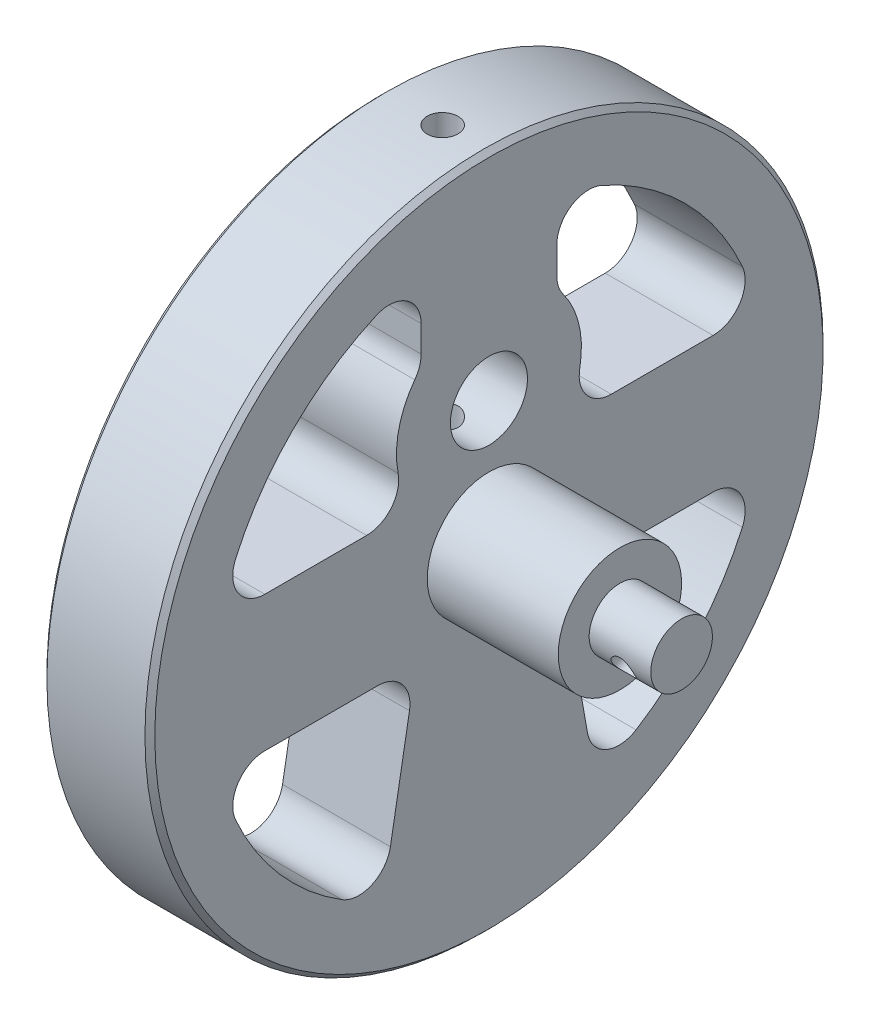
ISO-10303-21;
HEADER;
FILE_DESCRIPTION(('STEP AP214'),'2;1');
FILE_NAME('part.step','',(''),(''),'','','');
FILE_SCHEMA(('AUTOMOTIVE_DESIGN { 1 0 10303 214 1 1 1 1 }'));
ENDSEC;
DATA;
#1=APPLICATION_CONTEXT('core data for automotive mechanical design processes');
#2=APPLICATION_PROTOCOL_DEFINITION('international standard','automotive_design',2000,#1);
#3=PRODUCT_CONTEXT('',#1,'mechanical');
#4=PRODUCT('Part','Part','',(#3));
#5=PRODUCT_RELATED_PRODUCT_CATEGORY('part','',(#4));
#6=PRODUCT_DEFINITION_FORMATION('','',#4);
#7=PRODUCT_DEFINITION_CONTEXT('part definition',#1,'design');
#8=PRODUCT_DEFINITION('design','',#6,#7);
#9=PRODUCT_DEFINITION_SHAPE('','',#8);
#10=(LENGTH_UNIT() NAMED_UNIT(*) SI_UNIT(.MILLI.,.METRE.));
#11=(NAMED_UNIT(*) PLANE_ANGLE_UNIT() SI_UNIT($,.RADIAN.));
#12=(NAMED_UNIT(*) SI_UNIT($,.STERADIAN.) SOLID_ANGLE_UNIT());
#13=UNCERTAINTY_MEASURE_WITH_UNIT(LENGTH_MEASURE(1.E-05),#10,'distance_accuracy_value','');
#14=(GEOMETRIC_REPRESENTATION_CONTEXT(3) GLOBAL_UNCERTAINTY_ASSIGNED_CONTEXT((#13)) GLOBAL_UNIT_ASSIGNED_CONTEXT((#10,
#11,#12)) REPRESENTATION_CONTEXT('',''));
#15=CARTESIAN_POINT('',(0.,0.,0.));
#16=DIRECTION('',(0.,0.,1.));
#17=DIRECTION('',(1.,0.,0.));
#18=AXIS2_PLACEMENT_3D('',#15,#16,#17);
#19=CARTESIAN_POINT('',(0.,0.,0.));
#20=DIRECTION('',(-1.,0.,0.));
#21=DIRECTION('',(0.,0.,1.));
#22=AXIS2_PLACEMENT_3D('',#19,#20,#21);
#23=CYLINDRICAL_SURFACE('',#22,34.925);
#24=CARTESIAN_POINT('',(0.507999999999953,0.,0.));
#25=DIRECTION('',(1.,0.,0.));
#26=DIRECTION('',(0.,0.,-1.));
#27=AXIS2_PLACEMENT_3D('',#24,#25,#26);
#28=CIRCLE('',#27,34.925);
#29=CARTESIAN_POINT('',(0.507999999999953,0.,-34.925));
#30=VERTEX_POINT('',#29);
#31=EDGE_CURVE('E44',#30,#30,#28,.T.);
#32=ORIENTED_EDGE('',*,*,#31,.T.);
#33=EDGE_LOOP('',(#32));
#34=FACE_BOUND('',#33,.T.);
#35=CARTESIAN_POINT('',(10.6045,0.,0.));
#36=DIRECTION('',(-1.,0.,0.));
#37=DIRECTION('',(0.,0.,1.));
#38=AXIS2_PLACEMENT_3D('',#35,#36,#37);
#39=CIRCLE('',#38,34.925);
#40=CARTESIAN_POINT('',(10.6045,0.,34.925));
#41=VERTEX_POINT('',#40);
#42=EDGE_CURVE('E915',#41,#41,#39,.T.);
#43=ORIENTED_EDGE('',*,*,#42,.T.);
#44=EDGE_LOOP('',(#43));
#45=FACE_BOUND('',#44,.T.);
#46=CARTESIAN_POINT('',(4.7625,34.925,0.));
#47=CARTESIAN_POINT('',(4.76250393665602,34.9249995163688,0.0891211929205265));
#48=CARTESIAN_POINT('',(4.77003000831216,34.9246552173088,0.178305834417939));
#49=CARTESIAN_POINT('',(4.79994666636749,34.9233148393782,0.354215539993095));
#50=CARTESIAN_POINT('',(4.82235483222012,34.9223179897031,0.440937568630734));
#51=CARTESIAN_POINT('',(4.88139341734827,34.9197853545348,0.609348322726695));
#52=CARTESIAN_POINT('',(4.91801666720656,34.9182498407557,0.69103956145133));
#53=CARTESIAN_POINT('',(5.00443499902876,34.914812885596,0.847092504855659));
#54=CARTESIAN_POINT('',(5.05422694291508,34.9129115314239,0.921455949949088));
#55=CARTESIAN_POINT('',(5.16561729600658,34.908955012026,1.06082869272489));
#56=CARTESIAN_POINT('',(5.22722451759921,34.9068997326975,1.12583094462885));
#57=CARTESIAN_POINT('',(5.36047934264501,34.902867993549,1.24457619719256));
#58=CARTESIAN_POINT('',(5.43212735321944,34.9008915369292,1.29831874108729));
#59=CARTESIAN_POINT('',(5.58346534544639,34.8972395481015,1.39303724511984));
#60=CARTESIAN_POINT('',(5.66315865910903,34.8955641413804,1.43400788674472));
#61=CARTESIAN_POINT('',(5.82830156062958,34.8927045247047,1.5019854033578));
#62=CARTESIAN_POINT('',(5.91375111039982,34.8915203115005,1.52899237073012));
#63=CARTESIAN_POINT('',(6.08791771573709,34.8897776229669,1.56825779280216));
#64=CARTESIAN_POINT('',(6.17663245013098,34.8892187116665,1.58052652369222));
#65=CARTESIAN_POINT('',(6.35486385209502,34.8887883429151,1.58999890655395));
#66=CARTESIAN_POINT('',(6.44438051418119,34.8889168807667,1.58720266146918));
#67=CARTESIAN_POINT('',(6.62160492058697,34.8898465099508,1.56663304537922));
#68=CARTESIAN_POINT('',(6.70931395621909,34.890647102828,1.54887077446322));
#69=CARTESIAN_POINT('',(6.88050409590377,34.8928298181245,1.49889050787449));
#70=CARTESIAN_POINT('',(6.96398518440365,34.8942119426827,1.46667245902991));
#71=CARTESIAN_POINT('',(7.12438548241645,34.8974025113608,1.38868249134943));
#72=CARTESIAN_POINT('',(7.20130222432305,34.8992111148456,1.34290550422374));
#73=CARTESIAN_POINT('',(7.34636344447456,34.9030506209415,1.23910080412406));
#74=CARTESIAN_POINT('',(7.41450787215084,34.905081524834,1.18107302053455));
#75=CARTESIAN_POINT('',(7.54015471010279,34.9091389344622,1.05435124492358));
#76=CARTESIAN_POINT('',(7.59764742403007,34.911165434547,0.985647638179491));
#77=CARTESIAN_POINT('',(7.70028412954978,34.9149838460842,0.839558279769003));
#78=CARTESIAN_POINT('',(7.74542811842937,34.9167757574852,0.76217252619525));
#79=CARTESIAN_POINT('',(7.82208493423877,34.9199230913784,0.600909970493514));
#80=CARTESIAN_POINT('',(7.85359743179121,34.9212785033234,0.51703301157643));
#81=CARTESIAN_POINT('',(7.90209044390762,34.9233999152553,0.3451714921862));
#82=CARTESIAN_POINT('',(7.91907104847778,34.9241659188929,0.257186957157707));
#83=CARTESIAN_POINT('',(7.93800632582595,34.9250217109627,0.0796920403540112));
#84=CARTESIAN_POINT('',(7.93997441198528,34.9251121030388,-0.00981690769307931));
#85=CARTESIAN_POINT('',(7.92886377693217,34.9246080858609,-0.187893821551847));
#86=CARTESIAN_POINT('',(7.91578509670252,34.9240136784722,-0.276461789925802));
#87=CARTESIAN_POINT('',(7.87496328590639,34.9222074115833,-0.45010509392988));
#88=CARTESIAN_POINT('',(7.84722627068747,34.9209958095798,-0.535181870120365));
#89=CARTESIAN_POINT('',(7.77788134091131,34.9180915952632,-0.699472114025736));
#90=CARTESIAN_POINT('',(7.7362733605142,34.916398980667,-0.778685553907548));
#91=CARTESIAN_POINT('',(7.64033319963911,34.9127217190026,-0.929062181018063));
#92=CARTESIAN_POINT('',(7.58599201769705,34.9107368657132,-1.00021962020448));
#93=CARTESIAN_POINT('',(7.46614116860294,34.9066993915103,-1.13240657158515));
#94=CARTESIAN_POINT('',(7.40063144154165,34.9046467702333,-1.1934360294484));
#95=CARTESIAN_POINT('',(7.26024543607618,34.9007034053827,-1.30367968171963));
#96=CARTESIAN_POINT('',(7.18536234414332,34.8988127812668,-1.35288520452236));
#97=CARTESIAN_POINT('',(7.02838976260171,34.895408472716,-1.43802496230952));
#98=CARTESIAN_POINT('',(6.94630030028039,34.8938947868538,-1.47395924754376));
#99=CARTESIAN_POINT('',(6.77727746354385,34.8914158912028,-1.53152134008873));
#100=CARTESIAN_POINT('',(6.69034598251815,34.8904504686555,-1.55315469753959));
#101=CARTESIAN_POINT('',(6.51408020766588,34.8891763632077,-1.58151900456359));
#102=CARTESIAN_POINT('',(6.42474592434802,34.8888676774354,-1.58825001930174));
#103=CARTESIAN_POINT('',(6.24629679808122,34.8889419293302,-1.58661792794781));
#104=CARTESIAN_POINT('',(6.15718182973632,34.8893242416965,-1.57826846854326));
#105=CARTESIAN_POINT('',(5.98162016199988,34.8907360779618,-1.54674061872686));
#106=CARTESIAN_POINT('',(5.89517346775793,34.8917656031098,-1.52356219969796));
#107=CARTESIAN_POINT('',(5.72739904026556,34.8943556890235,-1.46303703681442));
#108=CARTESIAN_POINT('',(5.64607136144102,34.895916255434,-1.4256901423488));
#109=CARTESIAN_POINT('',(5.49084023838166,34.8993924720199,-1.33789080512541));
#110=CARTESIAN_POINT('',(5.41693655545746,34.9013081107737,-1.28743878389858));
#111=CARTESIAN_POINT('',(5.27858375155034,34.9052805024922,-1.17481347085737));
#112=CARTESIAN_POINT('',(5.21414220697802,34.9073373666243,-1.11263087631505));
#113=CARTESIAN_POINT('',(5.09659345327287,34.9113596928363,-0.978311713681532));
#114=CARTESIAN_POINT('',(5.04348904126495,34.9133251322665,-0.906172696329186));
#115=CARTESIAN_POINT('',(4.9501014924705,34.9169442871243,-0.753939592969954));
#116=CARTESIAN_POINT('',(4.90982959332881,34.9185977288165,-0.673838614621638));
#117=CARTESIAN_POINT('',(4.84335371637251,34.9214022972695,-0.508065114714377));
#118=CARTESIAN_POINT('',(4.81713307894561,34.9225540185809,-0.422399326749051));
#119=CARTESIAN_POINT('',(4.78640105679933,34.9239198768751,-0.280165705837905));
#120=CARTESIAN_POINT('',(4.77744955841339,34.9243231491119,-0.224519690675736));
#121=CARTESIAN_POINT('',(4.76549778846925,34.9248633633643,-0.112590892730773));
#122=CARTESIAN_POINT('',(4.76249751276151,34.9250003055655,-0.0563081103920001));
#123=CARTESIAN_POINT('',(4.7625,34.925,0.));
#124=B_SPLINE_CURVE_WITH_KNOTS('',3,(#46,#47,#48,#49,#50,#51,#52,#53,#54,#55,#56,#57,#58,#59,
#60,#61,#62,#63,#64,#65,#66,#67,#68,#69,#70,#71,#72,#73,#74,#75,#76,#77,#78,#79,#80,#81,#82,#83,
#84,#85,#86,#87,#88,#89,#90,#91,#92,#93,#94,#95,#96,#97,#98,#99,#100,#101,#102,#103,#104,#105,
#106,#107,#108,#109,#110,#111,#112,#113,#114,#115,#116,#117,#118,#119,#120,#121,#122,#123),
.UNSPECIFIED.,.T.,.F.,(4,2,2,2,2,2,2,2,2,2,2,2,2,2,2,2,2,2,2,2,2,2,2,2,2,2,2,2,2,2,2,2,2,2,2,2,
2,2,4),(0.,0.267158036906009,0.534632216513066,0.801971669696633,1.06924747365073,
1.33672340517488,1.60421018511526,1.87180820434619,2.13940445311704,2.40681401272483,
2.6742217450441,2.94143131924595,3.20864187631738,3.47595244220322,3.74326454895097,
4.01081880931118,4.27837312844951,4.54593391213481,4.81349303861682,5.08081307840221,
5.34813239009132,5.61534026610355,5.8825494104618,6.14994802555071,6.4173480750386,
6.68494363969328,6.95253819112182,7.22002882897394,7.48751829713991,7.75476582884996,
8.02201387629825,8.28926476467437,8.55650705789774,8.82396218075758,9.09148321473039,
9.35923788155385,9.62667438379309,9.79546896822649,9.96426343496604),.UNSPECIFIED.);
#125=CARTESIAN_POINT('',(4.7625,34.925,0.));
#126=VERTEX_POINT('',#125);
#127=EDGE_CURVE('E500',#126,#126,#124,.T.);
#128=ORIENTED_EDGE('',*,*,#127,.F.);
#129=EDGE_LOOP('',(#128));
#130=FACE_BOUND('',#129,.T.);
#131=ADVANCED_FACE('F36',(#34,#45,#130),#23,.T.);
#132=CARTESIAN_POINT('',(30.95625,12.7,0.));
#133=DIRECTION('',(-1.,0.,0.));
#134=DIRECTION('',(0.,0.,1.));
#135=AXIS2_PLACEMENT_3D('',#132,#133,#134);
#136=CYLINDRICAL_SURFACE('',#135,3.96875);
#137=CARTESIAN_POINT('',(6.35,9.06258054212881,-1.5875));
#138=CARTESIAN_POINT('',(6.26495802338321,9.06257195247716,-1.58749067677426));
#139=CARTESIAN_POINT('',(6.17979576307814,9.05955609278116,-1.58062598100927));
#140=CARTESIAN_POINT('',(6.01191422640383,9.04786961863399,-1.55342354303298));
#141=CARTESIAN_POINT('',(5.92920175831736,9.03918455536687,-1.53305137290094));
#142=CARTESIAN_POINT('',(5.76893297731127,9.01731388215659,-1.47973655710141));
#143=CARTESIAN_POINT('',(5.6913585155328,9.00414524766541,-1.44684127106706));
#144=CARTESIAN_POINT('',(5.54284749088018,8.97481484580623,-1.36955233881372));
#145=CARTESIAN_POINT('',(5.47190948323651,8.95865373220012,-1.32516120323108));
#146=CARTESIAN_POINT('',(5.33458705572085,8.92412438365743,-1.22342431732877));
#147=CARTESIAN_POINT('',(5.26862958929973,8.90568515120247,-1.16552611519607));
#148=CARTESIAN_POINT('',(5.14704885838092,8.8692636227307,-1.03958160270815));
#149=CARTESIAN_POINT('',(5.09142920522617,8.85128148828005,-0.971531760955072));
#150=CARTESIAN_POINT('',(4.98998367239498,8.81694794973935,-0.823917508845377));
#151=CARTESIAN_POINT('',(4.94463046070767,8.80068880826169,-0.744004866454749));
#152=CARTESIAN_POINT('',(4.86819291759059,8.77249382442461,-0.576917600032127));
#153=CARTESIAN_POINT('',(4.83710277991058,8.76055622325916,-0.489745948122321));
#154=CARTESIAN_POINT('',(4.79159769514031,8.74285204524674,-0.315092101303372));
#155=CARTESIAN_POINT('',(4.77644831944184,8.73681468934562,-0.227829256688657));
#156=CARTESIAN_POINT('',(4.76088988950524,8.73061253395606,-0.0518051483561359));
#157=CARTESIAN_POINT('',(4.76047533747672,8.73044554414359,0.0369555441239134));
#158=CARTESIAN_POINT('',(4.77399569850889,8.73583817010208,0.208147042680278));
#159=CARTESIAN_POINT('',(4.78712591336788,8.74107665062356,0.290653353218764));
#160=CARTESIAN_POINT('',(4.82599434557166,8.75625874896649,0.452178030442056));
#161=CARTESIAN_POINT('',(4.85173348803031,8.76620271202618,0.531196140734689));
#162=CARTESIAN_POINT('',(4.91540520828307,8.79001270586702,0.684925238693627));
#163=CARTESIAN_POINT('',(4.95351571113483,8.80393558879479,0.759553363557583));
#164=CARTESIAN_POINT('',(5.04068159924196,8.83432173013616,0.90154771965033));
#165=CARTESIAN_POINT('',(5.08974073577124,8.85078585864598,0.968911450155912));
#166=CARTESIAN_POINT('',(5.20116525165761,8.88585950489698,1.09916025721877));
#167=CARTESIAN_POINT('',(5.26419277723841,8.90453890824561,1.16146091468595));
#168=CARTESIAN_POINT('',(5.39987376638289,8.94110431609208,1.2748477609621));
#169=CARTESIAN_POINT('',(5.47253036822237,8.95899005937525,1.32593027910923));
#170=CARTESIAN_POINT('',(5.6280200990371,8.99241837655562,1.4167676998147));
#171=CARTESIAN_POINT('',(5.71108270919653,9.0078804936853,1.45616187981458));
#172=CARTESIAN_POINT('',(5.88344604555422,9.03376725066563,1.52017115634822));
#173=CARTESIAN_POINT('',(5.97274267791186,9.0441951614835,1.54479585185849));
#174=CARTESIAN_POINT('',(6.14920964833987,9.05803878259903,1.57714549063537));
#175=CARTESIAN_POINT('',(6.23617660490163,9.06184396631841,1.58581097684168));
#176=CARTESIAN_POINT('',(6.41038628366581,9.06312086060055,1.58873930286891));
#177=CARTESIAN_POINT('',(6.49762891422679,9.06059449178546,1.5830065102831));
#178=CARTESIAN_POINT('',(6.66468927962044,9.04989264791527,1.55815736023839));
#179=CARTESIAN_POINT('',(6.74464689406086,9.04204711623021,1.53982186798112));
#180=CARTESIAN_POINT('',(6.9002976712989,9.02200021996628,1.49130082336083));
#181=CARTESIAN_POINT('',(6.97598988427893,9.0097978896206,1.46111264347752));
#182=CARTESIAN_POINT('',(7.12438437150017,8.98180685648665,1.3883764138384));
#183=CARTESIAN_POINT('',(7.19684091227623,8.96589278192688,1.34537677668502));
#184=CARTESIAN_POINT('',(7.33383962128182,8.93246256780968,1.24869989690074));
#185=CARTESIAN_POINT('',(7.3983785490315,8.91494577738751,1.19501830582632));
#186=CARTESIAN_POINT('',(7.52266514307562,8.87872147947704,1.07382009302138));
#187=CARTESIAN_POINT('',(7.58170677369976,8.86002159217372,1.00557443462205));
#188=CARTESIAN_POINT('',(7.68760930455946,8.82475538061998,0.859697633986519));
#189=CARTESIAN_POINT('',(7.73446970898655,8.80818914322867,0.782066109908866));
#190=CARTESIAN_POINT('',(7.8145065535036,8.77900425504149,0.619347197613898));
#191=CARTESIAN_POINT('',(7.84768627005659,8.76638465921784,0.534261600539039));
#192=CARTESIAN_POINT('',(7.89904190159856,8.74654783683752,0.359087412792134));
#193=CARTESIAN_POINT('',(7.91722595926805,8.73932767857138,0.269001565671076));
#194=CARTESIAN_POINT('',(7.93710685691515,8.73141662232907,0.0927231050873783));
#195=CARTESIAN_POINT('',(7.93980197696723,8.73033046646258,0.00665995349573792));
#196=CARTESIAN_POINT('',(7.93126471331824,8.73374203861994,-0.164650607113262));
#197=CARTESIAN_POINT('',(7.92003443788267,8.73823892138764,-0.249898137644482));
#198=CARTESIAN_POINT('',(7.88467848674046,8.75211361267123,-0.414473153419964));
#199=CARTESIAN_POINT('',(7.86095952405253,8.76133724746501,-0.493902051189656));
#200=CARTESIAN_POINT('',(7.80172683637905,8.78367760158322,-0.647638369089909));
#201=CARTESIAN_POINT('',(7.76621093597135,8.79679503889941,-0.721944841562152));
#202=CARTESIAN_POINT('',(7.68262433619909,8.82635637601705,-0.866936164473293));
#203=CARTESIAN_POINT('',(7.63406819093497,8.84292165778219,-0.9373158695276));
#204=CARTESIAN_POINT('',(7.52650536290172,8.87738411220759,-1.06922413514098));
#205=CARTESIAN_POINT('',(7.46749435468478,8.89528183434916,-1.13074901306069));
#206=CARTESIAN_POINT('',(7.33638104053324,8.93176900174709,-1.24714100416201));
#207=CARTESIAN_POINT('',(7.26369445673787,8.95033267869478,-1.30136017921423));
#208=CARTESIAN_POINT('',(7.10966467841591,8.98485573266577,-1.39687891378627));
#209=CARTESIAN_POINT('',(7.0283204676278,9.00081480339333,-1.43817695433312));
#210=CARTESIAN_POINT('',(6.86670172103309,9.02685151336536,-1.50335542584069));
#211=CARTESIAN_POINT('',(6.78698696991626,9.03732858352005,-1.52846683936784));
#212=CARTESIAN_POINT('',(6.62425219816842,9.05314734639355,-1.56584472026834));
#213=CARTESIAN_POINT('',(6.54124206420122,9.05850334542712,-1.57814698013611));
#214=CARTESIAN_POINT('',(6.42193155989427,9.06204960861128,-1.5862810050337));
#215=CARTESIAN_POINT('',(6.38597654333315,9.06258417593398,-1.58750394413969));
#216=CARTESIAN_POINT('',(6.35,9.06258054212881,-1.5875));
#217=B_SPLINE_CURVE_WITH_KNOTS('',3,(#137,#138,#139,#140,#141,#142,#143,#144,#145,#146,#147,
#148,#149,#150,#151,#152,#153,#154,#155,#156,#157,#158,#159,#160,#161,#162,#163,#164,#165,#166,
#167,#168,#169,#170,#171,#172,#173,#174,#175,#176,#177,#178,#179,#180,#181,#182,#183,#184,#185,
#186,#187,#188,#189,#190,#191,#192,#193,#194,#195,#196,#197,#198,#199,#200,#201,#202,#203,#204,
#205,#206,#207,#208,#209,#210,#211,#212,#213,#214,#215,#216),.UNSPECIFIED.,.T.,.F.,(4,2,2,2,2,2,
2,2,2,2,2,2,2,2,2,2,2,2,2,2,2,2,2,2,2,2,2,2,2,2,2,2,2,2,2,2,2,2,2,4),(0.,0.255014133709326,
0.510680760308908,0.765389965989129,1.0200435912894,1.28790397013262,1.55585774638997,
1.83437743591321,2.11278364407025,2.37771132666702,2.64254015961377,2.89249361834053,
3.14246541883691,3.3962046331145,3.6500309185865,3.92052209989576,4.19110165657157,
4.46932414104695,4.74736560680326,5.00842079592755,5.26939680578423,5.5155087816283,
5.76167534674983,6.01782479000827,6.27407872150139,6.54926089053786,6.82445425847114,
7.09958168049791,7.37455960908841,7.63159700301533,7.88859548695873,8.13769958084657,
8.38684963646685,8.64700971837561,8.90727768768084,9.18365776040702,9.46007031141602,
9.71166349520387,9.96255175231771,10.0704340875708),.UNSPECIFIED.);
#218=CARTESIAN_POINT('',(6.35,9.06258054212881,-1.5875));
#219=VERTEX_POINT('',#218);
#220=EDGE_CURVE('E469',#219,#219,#217,.T.);
#221=ORIENTED_EDGE('',*,*,#220,.F.);
#222=EDGE_LOOP('',(#221));
#223=FACE_BOUND('',#222,.T.);
#224=CARTESIAN_POINT('',(0.,12.7,0.));
#225=DIRECTION('',(-1.,0.,0.));
#226=DIRECTION('',(0.,0.,1.));
#227=AXIS2_PLACEMENT_3D('',#224,#225,#226);
#228=CIRCLE('',#227,3.96875);
#229=CARTESIAN_POINT('',(0.,12.7,3.96875));
#230=VERTEX_POINT('',#229);
#231=EDGE_CURVE('E440',#230,#230,#228,.T.);
#232=ORIENTED_EDGE('',*,*,#231,.T.);
#233=EDGE_LOOP('',(#232));
#234=FACE_BOUND('',#233,.T.);
#235=CARTESIAN_POINT('',(11.1125,12.7,0.));
#236=DIRECTION('',(-1.,0.,0.));
#237=DIRECTION('',(0.,0.,1.));
#238=AXIS2_PLACEMENT_3D('',#235,#236,#237);
#239=CIRCLE('',#238,3.96875);
#240=CARTESIAN_POINT('',(11.1125,12.7,3.96875));
#241=VERTEX_POINT('',#240);
#242=EDGE_CURVE('E453',#241,#241,#239,.T.);
#243=ORIENTED_EDGE('',*,*,#242,.F.);
#244=EDGE_LOOP('',(#243));
#245=FACE_BOUND('',#244,.T.);
#246=CARTESIAN_POINT('',(6.35,16.3374194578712,-1.5875));
#247=CARTESIAN_POINT('',(6.43504197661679,16.3374280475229,-1.58749067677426));
#248=CARTESIAN_POINT('',(6.52020423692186,16.3404439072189,-1.58062598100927));
#249=CARTESIAN_POINT('',(6.68808577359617,16.352130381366,-1.55342354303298));
#250=CARTESIAN_POINT('',(6.77079824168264,16.3608154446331,-1.53305137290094));
#251=CARTESIAN_POINT('',(6.93106702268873,16.3826861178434,-1.47973655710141));
#252=CARTESIAN_POINT('',(7.0086414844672,16.3958547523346,-1.44684127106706));
#253=CARTESIAN_POINT('',(7.15715250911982,16.4251851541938,-1.36955233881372));
#254=CARTESIAN_POINT('',(7.2280905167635,16.4413462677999,-1.32516120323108));
#255=CARTESIAN_POINT('',(7.36541294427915,16.4758756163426,-1.22342431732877));
#256=CARTESIAN_POINT('',(7.43137041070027,16.4943148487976,-1.16552611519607));
#257=CARTESIAN_POINT('',(7.55295114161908,16.5307363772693,-1.03958160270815));
#258=CARTESIAN_POINT('',(7.60857079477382,16.54871851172,-0.971531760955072));
#259=CARTESIAN_POINT('',(7.71001632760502,16.5830520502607,-0.823917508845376));
#260=CARTESIAN_POINT('',(7.75536953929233,16.5993111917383,-0.744004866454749));
#261=CARTESIAN_POINT('',(7.83180708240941,16.6275061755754,-0.576917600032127));
#262=CARTESIAN_POINT('',(7.86289722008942,16.6394437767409,-0.489745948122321));
#263=CARTESIAN_POINT('',(7.90840230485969,16.6571479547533,-0.315092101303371));
#264=CARTESIAN_POINT('',(7.92355168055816,16.6631853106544,-0.227829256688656));
#265=CARTESIAN_POINT('',(7.93911011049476,16.669387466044,-0.0518051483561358));
#266=CARTESIAN_POINT('',(7.93952466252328,16.6695544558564,0.0369555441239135));
#267=CARTESIAN_POINT('',(7.9260043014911,16.6641618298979,0.208147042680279));
#268=CARTESIAN_POINT('',(7.91287408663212,16.6589233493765,0.290653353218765));
#269=CARTESIAN_POINT('',(7.87400565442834,16.6437412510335,0.452178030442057));
#270=CARTESIAN_POINT('',(7.84826651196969,16.6337972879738,0.531196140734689));
#271=CARTESIAN_POINT('',(7.78459479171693,16.609987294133,0.684925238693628));
#272=CARTESIAN_POINT('',(7.74648428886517,16.5960644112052,0.759553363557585));
#273=CARTESIAN_POINT('',(7.65931840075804,16.5656782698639,0.901547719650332));
#274=CARTESIAN_POINT('',(7.61025926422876,16.549214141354,0.968911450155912));
#275=CARTESIAN_POINT('',(7.49883474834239,16.514140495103,1.09916025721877));
#276=CARTESIAN_POINT('',(7.43580722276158,16.4954610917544,1.16146091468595));
#277=CARTESIAN_POINT('',(7.30012623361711,16.4588956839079,1.2748477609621));
#278=CARTESIAN_POINT('',(7.22746963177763,16.4410099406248,1.32593027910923));
#279=CARTESIAN_POINT('',(7.07197990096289,16.4075816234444,1.4167676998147));
#280=CARTESIAN_POINT('',(6.98891729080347,16.3921195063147,1.45616187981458));
#281=CARTESIAN_POINT('',(6.81655395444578,16.3662327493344,1.52017115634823));
#282=CARTESIAN_POINT('',(6.72725732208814,16.3558048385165,1.54479585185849));
#283=CARTESIAN_POINT('',(6.55079035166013,16.341961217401,1.57714549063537));
#284=CARTESIAN_POINT('',(6.46382339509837,16.3381560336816,1.58581097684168));
#285=CARTESIAN_POINT('',(6.28961371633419,16.3368791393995,1.58873930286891));
#286=CARTESIAN_POINT('',(6.20237108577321,16.3394055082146,1.5830065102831));
#287=CARTESIAN_POINT('',(6.03531072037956,16.3501073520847,1.55815736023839));
#288=CARTESIAN_POINT('',(5.95535310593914,16.3579528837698,1.53982186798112));
#289=CARTESIAN_POINT('',(5.79970232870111,16.3779997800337,1.49130082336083));
#290=CARTESIAN_POINT('',(5.72401011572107,16.3902021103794,1.46111264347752));
#291=CARTESIAN_POINT('',(5.57561562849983,16.4181931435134,1.3883764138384));
#292=CARTESIAN_POINT('',(5.50315908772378,16.4341072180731,1.34537677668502));
#293=CARTESIAN_POINT('',(5.36616037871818,16.4675374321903,1.24869989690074));
#294=CARTESIAN_POINT('',(5.3016214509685,16.4850542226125,1.19501830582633));
#295=CARTESIAN_POINT('',(5.17733485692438,16.521278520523,1.07382009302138));
#296=CARTESIAN_POINT('',(5.11829322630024,16.5399784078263,1.00557443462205));
#297=CARTESIAN_POINT('',(5.01239069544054,16.57524461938,0.85969763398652));
#298=CARTESIAN_POINT('',(4.96553029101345,16.5918108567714,0.782066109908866));
#299=CARTESIAN_POINT('',(4.8854934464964,16.6209957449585,0.619347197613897));
#300=CARTESIAN_POINT('',(4.85231372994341,16.6336153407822,0.534261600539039));
#301=CARTESIAN_POINT('',(4.80095809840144,16.6534521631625,0.359087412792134));
#302=CARTESIAN_POINT('',(4.78277404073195,16.6606723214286,0.269001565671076));
#303=CARTESIAN_POINT('',(4.76289314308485,16.668583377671,0.0927231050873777));
#304=CARTESIAN_POINT('',(4.76019802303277,16.6696695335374,0.006659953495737));
#305=CARTESIAN_POINT('',(4.76873528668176,16.6662579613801,-0.164650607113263));
#306=CARTESIAN_POINT('',(4.77996556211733,16.6617610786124,-0.249898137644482));
#307=CARTESIAN_POINT('',(4.81532151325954,16.6478863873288,-0.414473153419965));
#308=CARTESIAN_POINT('',(4.83904047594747,16.638662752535,-0.493902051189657));
#309=CARTESIAN_POINT('',(4.89827316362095,16.6163223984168,-0.64763836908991));
#310=CARTESIAN_POINT('',(4.93378906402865,16.6032049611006,-0.721944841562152));
#311=CARTESIAN_POINT('',(5.01737566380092,16.573643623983,-0.866936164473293));
#312=CARTESIAN_POINT('',(5.06593180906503,16.5570783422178,-0.937315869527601));
#313=CARTESIAN_POINT('',(5.17349463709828,16.5226158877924,-1.06922413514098));
#314=CARTESIAN_POINT('',(5.23250564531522,16.5047181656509,-1.1307490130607));
#315=CARTESIAN_POINT('',(5.36361895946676,16.4682309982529,-1.24714100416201));
#316=CARTESIAN_POINT('',(5.43630554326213,16.4496673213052,-1.30136017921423));
#317=CARTESIAN_POINT('',(5.59033532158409,16.4151442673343,-1.39687891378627));
#318=CARTESIAN_POINT('',(5.6716795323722,16.3991851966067,-1.43817695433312));
#319=CARTESIAN_POINT('',(5.83329827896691,16.3731484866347,-1.50335542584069));
#320=CARTESIAN_POINT('',(5.91301303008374,16.36267141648,-1.52846683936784));
#321=CARTESIAN_POINT('',(6.07574780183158,16.3468526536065,-1.56584472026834));
#322=CARTESIAN_POINT('',(6.15875793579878,16.3414966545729,-1.57814698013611));
#323=CARTESIAN_POINT('',(6.27806844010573,16.3379503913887,-1.5862810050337));
#324=CARTESIAN_POINT('',(6.31402345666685,16.337415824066,-1.58750394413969));
#325=CARTESIAN_POINT('',(6.35,16.3374194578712,-1.5875));
#326=B_SPLINE_CURVE_WITH_KNOTS('',3,(#246,#247,#248,#249,#250,#251,#252,#253,#254,#255,#256,
#257,#258,#259,#260,#261,#262,#263,#264,#265,#266,#267,#268,#269,#270,#271,#272,#273,#274,#275,
#276,#277,#278,#279,#280,#281,#282,#283,#284,#285,#286,#287,#288,#289,#290,#291,#292,#293,#294,
#295,#296,#297,#298,#299,#300,#301,#302,#303,#304,#305,#306,#307,#308,#309,#310,#311,#312,#313,
#314,#315,#316,#317,#318,#319,#320,#321,#322,#323,#324,#325),.UNSPECIFIED.,.T.,.F.,(4,2,2,2,2,2,
2,2,2,2,2,2,2,2,2,2,2,2,2,2,2,2,2,2,2,2,2,2,2,2,2,2,2,2,2,2,2,2,2,4),(0.,0.255014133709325,
0.510680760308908,0.765389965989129,1.0200435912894,1.28790397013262,1.55585774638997,
1.83437743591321,2.11278364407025,2.37771132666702,2.64254015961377,2.89249361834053,
3.14246541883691,3.39620463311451,3.6500309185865,3.92052209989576,4.19110165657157,
4.46932414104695,4.74736560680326,5.00842079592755,5.26939680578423,5.5155087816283,
5.76167534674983,6.01782479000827,6.27407872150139,6.54926089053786,6.82445425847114,
7.09958168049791,7.37455960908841,7.63159700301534,7.88859548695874,8.13769958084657,
8.38684963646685,8.64700971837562,8.90727768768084,9.18365776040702,9.46007031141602,
9.71166349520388,9.96255175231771,10.0704340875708),.UNSPECIFIED.);
#327=CARTESIAN_POINT('',(6.35,16.3374194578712,-1.5875));
#328=VERTEX_POINT('',#327);
#329=EDGE_CURVE('E476',#328,#328,#326,.T.);
#330=ORIENTED_EDGE('',*,*,#329,.F.);
#331=EDGE_LOOP('',(#330));
#332=FACE_BOUND('',#331,.T.);
#333=ADVANCED_FACE('F481',(#223,#234,#245,#332),#136,.F.);
#334=CARTESIAN_POINT('',(30.95625,3.175,0.));
#335=DIRECTION('',(-1.,0.,0.));
#336=DIRECTION('',(0.,0.,1.));
#337=AXIS2_PLACEMENT_3D('',#334,#335,#336);
#338=PLANE('',#337);
#339=CARTESIAN_POINT('',(30.95625,0.,0.));
#340=DIRECTION('',(-1.,0.,0.));
#341=DIRECTION('',(0.,0.,1.));
#342=AXIS2_PLACEMENT_3D('',#339,#340,#341);
#343=CIRCLE('',#342,3.175);
#344=CARTESIAN_POINT('',(30.95625,0.,3.175));
#345=VERTEX_POINT('',#344);
#346=EDGE_CURVE('E465',#345,#345,#343,.T.);
#347=ORIENTED_EDGE('',*,*,#346,.F.);
#348=EDGE_LOOP('',(#347));
#349=FACE_BOUND('',#348,.T.);
#350=ADVANCED_FACE('F526',(#349),#338,.F.);
#351=CARTESIAN_POINT('',(0.,0.,0.));
#352=DIRECTION('',(-1.,0.,0.));
#353=DIRECTION('',(0.,0.,1.));
#354=AXIS2_PLACEMENT_3D('',#351,#352,#353);
#355=CYLINDRICAL_SURFACE('',#354,3.175);
#356=CARTESIAN_POINT('',(27.78125,0.302969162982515,-3.16051177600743));
#357=CARTESIAN_POINT('',(27.8455496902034,0.302965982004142,-3.16051089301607));
#358=CARTESIAN_POINT('',(27.9098334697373,0.308588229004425,-3.15998790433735));
#359=CARTESIAN_POINT('',(28.0364629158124,0.330736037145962,-3.15774622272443));
#360=CARTESIAN_POINT('',(28.098808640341,0.347261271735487,-3.15602756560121));
#361=CARTESIAN_POINT('',(28.2196979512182,0.390278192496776,-3.15099515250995));
#362=CARTESIAN_POINT('',(28.2782502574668,0.416745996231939,-3.14768521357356));
#363=CARTESIAN_POINT('',(28.3903514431,0.478457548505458,-3.13889657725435));
#364=CARTESIAN_POINT('',(28.4438988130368,0.513703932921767,-3.13341722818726));
#365=CARTESIAN_POINT('',(28.5471316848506,0.593417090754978,-3.11932504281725));
#366=CARTESIAN_POINT('',(28.5965332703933,0.638228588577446,-3.11058177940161));
#367=CARTESIAN_POINT('',(28.6874924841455,0.734440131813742,-3.0892795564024));
#368=CARTESIAN_POINT('',(28.7290484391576,0.785841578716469,-3.07671978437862));
#369=CARTESIAN_POINT('',(28.8045044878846,0.895434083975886,-3.04666289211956));
#370=CARTESIAN_POINT('',(28.8380959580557,0.953796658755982,-3.02901230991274));
#371=CARTESIAN_POINT('',(28.8946043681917,1.07381849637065,-2.9885683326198));
#372=CARTESIAN_POINT('',(28.9175250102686,1.13547660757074,-2.96577672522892));
#373=CARTESIAN_POINT('',(28.9510453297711,1.25722784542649,-2.91618500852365));
#374=CARTESIAN_POINT('',(28.9621338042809,1.3172737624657,-2.88960020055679));
#375=CARTESIAN_POINT('',(28.9732412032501,1.43638880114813,-2.83227383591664));
#376=CARTESIAN_POINT('',(28.9732637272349,1.49545823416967,-2.80153363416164));
#377=CARTESIAN_POINT('',(28.962523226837,1.60788516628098,-2.73848169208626));
#378=CARTESIAN_POINT('',(28.9522937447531,1.66138067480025,-2.70632294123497));
#379=CARTESIAN_POINT('',(28.9222371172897,1.76445647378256,-2.64027783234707));
#380=CARTESIAN_POINT('',(28.902409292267,1.81403648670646,-2.60639135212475));
#381=CARTESIAN_POINT('',(28.8534709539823,1.9089614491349,-2.53771082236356));
#382=CARTESIAN_POINT('',(28.8242295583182,1.95423427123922,-2.50291074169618));
#383=CARTESIAN_POINT('',(28.7574100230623,2.03903419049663,-2.43432603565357));
#384=CARTESIAN_POINT('',(28.7198291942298,2.07855942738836,-2.40054174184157));
#385=CARTESIAN_POINT('',(28.6348270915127,2.15356029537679,-2.33355489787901));
#386=CARTESIAN_POINT('',(28.5869587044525,2.18866366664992,-2.30050204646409));
#387=CARTESIAN_POINT('',(28.484041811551,2.25160941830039,-2.23893348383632));
#388=CARTESIAN_POINT('',(28.4289915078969,2.27944997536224,-2.21041891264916));
#389=CARTESIAN_POINT('',(28.3116976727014,2.32813005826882,-2.15910131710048));
#390=CARTESIAN_POINT('',(28.2493216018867,2.3488004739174,-2.1364391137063));
#391=CARTESIAN_POINT('',(28.1201048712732,2.38197628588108,-2.09939035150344));
#392=CARTESIAN_POINT('',(28.0532667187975,2.39448622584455,-2.08499918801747));
#393=CARTESIAN_POINT('',(27.9209690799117,2.41067042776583,-2.06626205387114));
#394=CARTESIAN_POINT('',(27.8556369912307,2.41479410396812,-2.06140566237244));
#395=CARTESIAN_POINT('',(27.7248863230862,2.41548555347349,-2.06059608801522));
#396=CARTESIAN_POINT('',(27.6594677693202,2.41205521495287,-2.06464068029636));
#397=CARTESIAN_POINT('',(27.5336556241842,2.39805316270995,-2.08088199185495));
#398=CARTESIAN_POINT('',(27.4731709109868,2.38782817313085,-2.0926826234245));
#399=CARTESIAN_POINT('',(27.3555238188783,2.36074607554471,-2.12318533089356));
#400=CARTESIAN_POINT('',(27.2983621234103,2.34388760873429,-2.14188882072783));
#401=CARTESIAN_POINT('',(27.186600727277,2.30297934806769,-2.18582748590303));
#402=CARTESIAN_POINT('',(27.132177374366,2.27868368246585,-2.21128121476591));
#403=CARTESIAN_POINT('',(27.029466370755,2.22338730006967,-2.26687207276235));
#404=CARTESIAN_POINT('',(26.9811809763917,2.19238412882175,-2.29701091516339));
#405=CARTESIAN_POINT('',(26.8889413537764,2.12175301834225,-2.36246640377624));
#406=CARTESIAN_POINT('',(26.8454557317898,2.08170292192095,-2.39799016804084));
#407=CARTESIAN_POINT('',(26.7677595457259,1.99475688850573,-2.47078538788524));
#408=CARTESIAN_POINT('',(26.7335490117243,1.94786092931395,-2.50805684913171));
#409=CARTESIAN_POINT('',(26.6755990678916,1.848139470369,-2.58241277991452));
#410=CARTESIAN_POINT('',(26.6518238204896,1.79533505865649,-2.61949745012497));
#411=CARTESIAN_POINT('',(26.6155039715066,1.68486697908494,-2.69187655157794));
#412=CARTESIAN_POINT('',(26.602954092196,1.62720560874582,-2.72717181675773));
#413=CARTESIAN_POINT('',(26.5900103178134,1.51215645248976,-2.79251306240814));
#414=CARTESIAN_POINT('',(26.5889505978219,1.45494857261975,-2.82274508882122));
#415=CARTESIAN_POINT('',(26.5973045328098,1.33941371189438,-2.87936324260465));
#416=CARTESIAN_POINT('',(26.6067169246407,1.28108686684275,-2.90574983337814));
#417=CARTESIAN_POINT('',(26.6352804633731,1.16656352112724,-2.9535598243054));
#418=CARTESIAN_POINT('',(26.654188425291,1.11034976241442,-2.9750886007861));
#419=CARTESIAN_POINT('',(26.7009641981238,1.00023731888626,-3.01389479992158));
#420=CARTESIAN_POINT('',(26.7288337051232,0.946339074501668,-3.03117141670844));
#421=CARTESIAN_POINT('',(26.7940741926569,0.840194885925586,-3.06233346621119));
#422=CARTESIAN_POINT('',(26.8317953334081,0.788113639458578,-3.07604581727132));
#423=CARTESIAN_POINT('',(26.9151162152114,0.689682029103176,-3.09960151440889));
#424=CARTESIAN_POINT('',(26.960718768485,0.643333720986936,-3.10944347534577));
#425=CARTESIAN_POINT('',(27.0613696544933,0.555599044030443,-3.12634562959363));
#426=CARTESIAN_POINT('',(27.11678949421,0.514603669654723,-3.1332315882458));
#427=CARTESIAN_POINT('',(27.2338925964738,0.442295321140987,-3.14425551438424));
#428=CARTESIAN_POINT('',(27.2955765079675,0.410983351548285,-3.14839319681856));
#429=CARTESIAN_POINT('',(27.4264085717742,0.358474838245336,-3.15481519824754));
#430=CARTESIAN_POINT('',(27.4957654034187,0.337781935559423,-3.15701031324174));
#431=CARTESIAN_POINT('',(27.6371726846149,0.310035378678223,-3.15985858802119));
#432=CARTESIAN_POINT('',(27.7092213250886,0.3029727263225,-3.16051276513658));
#433=CARTESIAN_POINT('',(27.78125,0.302969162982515,-3.16051177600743));
#434=B_SPLINE_CURVE_WITH_KNOTS('',3,(#356,#357,#358,#359,#360,#361,#362,#363,#364,#365,#366,
#367,#368,#369,#370,#371,#372,#373,#374,#375,#376,#377,#378,#379,#380,#381,#382,#383,#384,#385,
#386,#387,#388,#389,#390,#391,#392,#393,#394,#395,#396,#397,#398,#399,#400,#401,#402,#403,#404,
#405,#406,#407,#408,#409,#410,#411,#412,#413,#414,#415,#416,#417,#418,#419,#420,#421,#422,#423,
#424,#425,#426,#427,#428,#429,#430,#431,#432,#433),.UNSPECIFIED.,.T.,.F.,(4,2,2,2,2,2,2,2,2,2,2,
2,2,2,2,2,2,2,2,2,2,2,2,2,2,2,2,2,2,2,2,2,2,2,2,2,2,2,4),(0.,0.192630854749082,
0.385255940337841,0.577421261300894,0.76964435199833,0.970555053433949,1.17150855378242,
1.37929994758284,1.58701919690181,1.78577889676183,1.98447394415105,2.17333887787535,
2.36221718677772,2.55384404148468,2.74553278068,2.94843735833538,3.15139282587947,
3.35885307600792,3.56619771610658,3.7621024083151,3.95795813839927,4.14451677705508,
4.33111365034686,4.52470489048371,4.71836709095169,4.92430607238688,5.13024572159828,
5.33547247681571,5.5406026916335,5.73377790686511,5.92692982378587,6.11536967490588,
6.3038452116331,6.50024356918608,6.69671215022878,6.90355013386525,7.11040956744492,
7.32633773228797,7.54212330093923),.UNSPECIFIED.);
#435=CARTESIAN_POINT('',(27.78125,0.302969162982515,-3.16051177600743));
#436=VERTEX_POINT('',#435);
#437=EDGE_CURVE('E533',#436,#436,#434,.T.);
#438=ORIENTED_EDGE('',*,*,#437,.T.);
#439=EDGE_LOOP('',(#438));
#440=FACE_BOUND('',#439,.T.);
#441=CARTESIAN_POINT('',(27.78125,-2.41516370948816,2.06097289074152));
#442=CARTESIAN_POINT('',(27.7169503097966,-2.41516481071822,2.06096977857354));
#443=CARTESIAN_POINT('',(27.6526665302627,-2.4115116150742,2.06527527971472));
#444=CARTESIAN_POINT('',(27.5260370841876,-2.39697187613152,2.0821319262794));
#445=CARTESIAN_POINT('',(27.463691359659,-2.38608554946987,2.09468282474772));
#446=CARTESIAN_POINT('',(27.3428020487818,-2.3572897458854,2.12703374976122));
#447=CARTESIAN_POINT('',(27.2842497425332,-2.33939709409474,2.14681640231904));
#448=CARTESIAN_POINT('',(27.1721485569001,-2.29680157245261,2.19232659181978));
#449=CARTESIAN_POINT('',(27.1186011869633,-2.27209665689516,2.21805591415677));
#450=CARTESIAN_POINT('',(27.0153683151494,-2.21483142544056,2.27527016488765));
#451=CARTESIAN_POINT('',(26.9659667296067,-2.18196654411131,2.30696266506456));
#452=CARTESIAN_POINT('',(26.8750075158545,-2.1093321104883,2.37355609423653));
#453=CARTESIAN_POINT('',(26.8334515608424,-2.06956108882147,2.40845770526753));
#454=CARTESIAN_POINT('',(26.7579955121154,-1.98208024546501,2.48099070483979));
#455=CARTESIAN_POINT('',(26.7244040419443,-1.93414633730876,2.51867456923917));
#456=CARTESIAN_POINT('',(26.6678956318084,-1.83217487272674,2.593792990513));
#457=CARTESIAN_POINT('',(26.6449749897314,-1.77813944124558,2.63122762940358));
#458=CARTESIAN_POINT('',(26.6114546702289,-1.66768264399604,2.70251576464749));
#459=CARTESIAN_POINT('',(26.6003661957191,-1.61146472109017,2.73645408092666));
#460=CARTESIAN_POINT('',(26.5892587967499,-1.49618413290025,2.80114635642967));
#461=CARTESIAN_POINT('',(26.5892362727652,-1.43712239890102,2.83190134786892));
#462=CARTESIAN_POINT('',(26.599976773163,-1.32098783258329,2.88783099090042));
#463=CARTESIAN_POINT('',(26.6102062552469,-1.26396116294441,2.91320644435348));
#464=CARTESIAN_POINT('',(26.6402628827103,-1.15073832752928,2.95975927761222));
#465=CARTESIAN_POINT('',(26.660090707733,-1.09454222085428,2.98093635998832));
#466=CARTESIAN_POINT('',(26.7090290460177,-0.983835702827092,3.0193008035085));
#467=CARTESIAN_POINT('',(26.7382704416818,-0.929361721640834,3.03642562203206));
#468=CARTESIAN_POINT('',(26.8050899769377,-0.824541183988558,3.0665510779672));
#469=CARTESIAN_POINT('',(26.8426708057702,-0.774195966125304,3.07955038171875));
#470=CARTESIAN_POINT('',(26.9276729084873,-0.676304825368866,3.10256542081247));
#471=CARTESIAN_POINT('',(26.9755412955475,-0.629095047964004,3.11236208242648));
#472=CARTESIAN_POINT('',(27.078458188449,-0.54255683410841,3.12860994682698));
#473=CARTESIAN_POINT('',(27.1335084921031,-0.503230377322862,3.13506030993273));
#474=CARTESIAN_POINT('',(27.2508023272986,-0.433271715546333,3.14550213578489));
#475=CARTESIAN_POINT('',(27.3131783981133,-0.402851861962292,3.14943584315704));
#476=CARTESIAN_POINT('',(27.4423951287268,-0.353474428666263,3.15536158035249));
#477=CARTESIAN_POINT('',(27.5092332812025,-0.33451047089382,3.15735469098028));
#478=CARTESIAN_POINT('',(27.6415309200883,-0.309879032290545,3.1598648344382));
#479=CARTESIAN_POINT('',(27.7068630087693,-0.303535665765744,3.16045724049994));
#480=CARTESIAN_POINT('',(27.8376136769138,-0.302475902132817,3.16055929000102));
#481=CARTESIAN_POINT('',(27.9030322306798,-0.307756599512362,3.16006920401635));
#482=CARTESIAN_POINT('',(28.0288443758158,-0.329091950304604,3.15791502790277));
#483=CARTESIAN_POINT('',(28.0893290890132,-0.344623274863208,3.15630777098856));
#484=CARTESIAN_POINT('',(28.2069761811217,-0.385143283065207,3.15161904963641));
#485=CARTESIAN_POINT('',(28.2641378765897,-0.410133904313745,3.14853728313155));
#486=CARTESIAN_POINT('',(28.375899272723,-0.469590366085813,3.14022938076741));
#487=CARTESIAN_POINT('',(28.430322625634,-0.504376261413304,3.13492719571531));
#488=CARTESIAN_POINT('',(28.533033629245,-0.581630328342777,3.12151665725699));
#489=CARTESIAN_POINT('',(28.5813190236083,-0.624101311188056,3.11340727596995));
#490=CARTESIAN_POINT('',(28.6735586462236,-0.718231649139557,3.09309338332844));
#491=CARTESIAN_POINT('',(28.7170442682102,-0.770302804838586,3.08066185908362));
#492=CARTESIAN_POINT('',(28.7947404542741,-0.879803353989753,3.05119346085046));
#493=CARTESIAN_POINT('',(28.8289509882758,-0.937232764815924,3.03415657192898));
#494=CARTESIAN_POINT('',(28.8869009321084,-1.05533945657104,2.99511834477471));
#495=CARTESIAN_POINT('',(28.9106761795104,-1.1160048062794,2.97313439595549));
#496=CARTESIAN_POINT('',(28.9469960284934,-1.23865618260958,2.92415918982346));
#497=CARTESIAN_POINT('',(28.959545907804,-1.30064157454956,2.89717029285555));
#498=CARTESIAN_POINT('',(28.9724896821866,-1.42015547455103,2.84040574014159));
#499=CARTESIAN_POINT('',(28.9735494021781,-1.47773319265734,2.81088416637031));
#500=CARTESIAN_POINT('',(28.9651954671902,-1.59038014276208,2.74871838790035));
#501=CARTESIAN_POINT('',(28.9557830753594,-1.64544967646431,2.71607456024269));
#502=CARTESIAN_POINT('',(28.9272195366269,-1.75030122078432,2.64968521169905));
#503=CARTESIAN_POINT('',(28.9083115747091,-1.80017944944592,2.61598599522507));
#504=CARTESIAN_POINT('',(28.8615358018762,-1.89512552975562,2.54804548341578));
#505=CARTESIAN_POINT('',(28.8336662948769,-1.94019246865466,2.51380408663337));
#506=CARTESIAN_POINT('',(28.7684258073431,-2.02660073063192,2.44472967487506));
#507=CARTESIAN_POINT('',(28.7307046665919,-2.0677058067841,2.40993229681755));
#508=CARTESIAN_POINT('',(28.6473837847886,-2.14345955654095,2.3428128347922));
#509=CARTESIAN_POINT('',(28.601781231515,-2.17810591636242,2.31049164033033));
#510=CARTESIAN_POINT('',(28.5011303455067,-2.24227389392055,2.24831827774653));
#511=CARTESIAN_POINT('',(28.44571050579,-2.27142852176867,2.21868645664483));
#512=CARTESIAN_POINT('',(28.3286074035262,-2.32193315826,2.16577798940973));
#513=CARTESIAN_POINT('',(28.2669234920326,-2.34328235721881,2.14250200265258));
#514=CARTESIAN_POINT('',(28.1360914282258,-2.37866059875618,2.10317305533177));
#515=CARTESIAN_POINT('',(28.0667345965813,-2.39232769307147,2.08748148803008));
#516=CARTESIAN_POINT('',(27.9253273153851,-2.41057563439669,2.06638654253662));
#517=CARTESIAN_POINT('',(27.8532786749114,-2.41516247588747,2.06097637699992));
#518=CARTESIAN_POINT('',(27.78125,-2.41516370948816,2.06097289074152));
#519=B_SPLINE_CURVE_WITH_KNOTS('',3,(#441,#442,#443,#444,#445,#446,#447,#448,#449,#450,#451,
#452,#453,#454,#455,#456,#457,#458,#459,#460,#461,#462,#463,#464,#465,#466,#467,#468,#469,#470,
#471,#472,#473,#474,#475,#476,#477,#478,#479,#480,#481,#482,#483,#484,#485,#486,#487,#488,#489,
#490,#491,#492,#493,#494,#495,#496,#497,#498,#499,#500,#501,#502,#503,#504,#505,#506,#507,#508,
#509,#510,#511,#512,#513,#514,#515,#516,#517,#518),.UNSPECIFIED.,.T.,.F.,(4,2,2,2,2,2,2,2,2,2,2,
2,2,2,2,2,2,2,2,2,2,2,2,2,2,2,2,2,2,2,2,2,2,2,2,2,2,2,4),(0.,0.192630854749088,0.38525594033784,
0.57742126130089,0.769644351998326,0.970555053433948,1.17150855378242,1.37929994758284,
1.58701919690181,1.78577889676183,1.98447394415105,2.17333887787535,2.36221718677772,
2.55384404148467,2.74553278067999,2.94843735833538,3.15139282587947,3.35885307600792,
3.56619771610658,3.7621024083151,3.95795813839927,4.14451677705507,4.33111365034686,
4.5247048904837,4.71836709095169,4.92430607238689,5.13024572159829,5.33547247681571,
5.5406026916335,5.73377790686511,5.92692982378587,6.11536967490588,6.30384521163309,
6.50024356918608,6.69671215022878,6.90355013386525,7.11040956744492,7.32633773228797,
7.54212330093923),.UNSPECIFIED.);
#520=CARTESIAN_POINT('',(27.78125,-2.41516370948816,2.06097289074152));
#521=VERTEX_POINT('',#520);
#522=EDGE_CURVE('E529',#521,#521,#519,.T.);
#523=ORIENTED_EDGE('',*,*,#522,.T.);
#524=EDGE_LOOP('',(#523));
#525=FACE_BOUND('',#524,.T.);
#526=CARTESIAN_POINT('',(24.60625,0.,0.));
#527=DIRECTION('',(-1.,0.,0.));
#528=DIRECTION('',(0.,0.,1.));
#529=AXIS2_PLACEMENT_3D('',#526,#527,#528);
#530=CIRCLE('',#529,3.175);
#531=CARTESIAN_POINT('',(24.60625,0.,3.175));
#532=VERTEX_POINT('',#531);
#533=EDGE_CURVE('E462',#532,#532,#530,.T.);
#534=ORIENTED_EDGE('',*,*,#533,.F.);
#535=EDGE_LOOP('',(#534));
#536=FACE_BOUND('',#535,.T.);
#537=ORIENTED_EDGE('',*,*,#346,.T.);
#538=EDGE_LOOP('',(#537));
#539=FACE_BOUND('',#538,.T.);
#540=ADVANCED_FACE('F521',(#440,#525,#536,#539),#355,.T.);
#541=CARTESIAN_POINT('',(24.60625,6.35000000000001,0.));
#542=DIRECTION('',(-1.,0.,0.));
#543=DIRECTION('',(0.,0.,1.));
#544=AXIS2_PLACEMENT_3D('',#541,#542,#543);
#545=PLANE('',#544);
#546=CARTESIAN_POINT('',(24.60625,0.,0.));
#547=DIRECTION('',(-1.,0.,0.));
#548=DIRECTION('',(0.,0.,1.));
#549=AXIS2_PLACEMENT_3D('',#546,#547,#548);
#550=CIRCLE('',#549,6.35);
#551=CARTESIAN_POINT('',(24.60625,0.,6.35000000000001));
#552=VERTEX_POINT('',#551);
#553=EDGE_CURVE('E459',#552,#552,#550,.T.);
#554=ORIENTED_EDGE('',*,*,#553,.F.);
#555=EDGE_LOOP('',(#554));
#556=FACE_BOUND('',#555,.T.);
#557=ORIENTED_EDGE('',*,*,#533,.T.);
#558=EDGE_LOOP('',(#557));
#559=FACE_BOUND('',#558,.T.);
#560=ADVANCED_FACE('F517',(#556,#559),#545,.F.);
#561=CARTESIAN_POINT('',(0.,0.,0.));
#562=DIRECTION('',(-1.,0.,0.));
#563=DIRECTION('',(0.,0.,1.));
#564=AXIS2_PLACEMENT_3D('',#561,#562,#563);
#565=CYLINDRICAL_SURFACE('',#564,6.35);
#566=CARTESIAN_POINT('',(11.1125,0.,0.));
#567=DIRECTION('',(-1.,0.,0.));
#568=DIRECTION('',(0.,0.,1.));
#569=AXIS2_PLACEMENT_3D('',#566,#567,#568);
#570=CIRCLE('',#569,6.35);
#571=CARTESIAN_POINT('',(11.1125,0.,6.35000000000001));
#572=VERTEX_POINT('',#571);
#573=EDGE_CURVE('E456',#572,#572,#570,.T.);
#574=ORIENTED_EDGE('',*,*,#573,.F.);
#575=EDGE_LOOP('',(#574));
#576=FACE_BOUND('',#575,.T.);
#577=ORIENTED_EDGE('',*,*,#553,.T.);
#578=EDGE_LOOP('',(#577));
#579=FACE_BOUND('',#578,.T.);
#580=ADVANCED_FACE('F513',(#576,#579),#565,.T.);
#581=CARTESIAN_POINT('',(11.1125,6.35000000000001,0.));
#582=DIRECTION('',(-1.,0.,0.));
#583=DIRECTION('',(0.,0.,1.));
#584=AXIS2_PLACEMENT_3D('',#581,#582,#583);
#585=PLANE('',#584);
#586=CARTESIAN_POINT('',(11.1125,0.,0.));
#587=DIRECTION('',(-1.,0.,0.));
#588=DIRECTION('',(0.,0.,1.));
#589=AXIS2_PLACEMENT_3D('',#586,#587,#588);
#590=CIRCLE('',#589,34.417);
#591=CARTESIAN_POINT('',(11.1125,0.,34.417));
#592=VERTEX_POINT('',#591);
#593=EDGE_CURVE('E11',#592,#592,#590,.F.);
#594=ORIENTED_EDGE('',*,*,#593,.T.);
#595=EDGE_LOOP('',(#594));
#596=FACE_BOUND('',#595,.T.);
#597=CARTESIAN_POINT('',(11.1125,0.,0.));
#598=DIRECTION('',(1.,0.,0.));
#599=DIRECTION('',(0.,0.,-1.));
#600=AXIS2_PLACEMENT_3D('',#597,#598,#599);
#601=CIRCLE('',#600,28.575);
#602=CARTESIAN_POINT('',(11.1125,-24.2273829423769,-15.1513874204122));
#603=VERTEX_POINT('',#602);
#604=CARTESIAN_POINT('',(11.1125,-11.6310301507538,-26.1007617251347));
#605=VERTEX_POINT('',#604);
#606=EDGE_CURVE('E232',#603,#605,#601,.T.);
#607=ORIENTED_EDGE('',*,*,#606,.F.);
#608=CARTESIAN_POINT('',(11.1125,-21.4277742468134,-13.400560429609));
#609=DIRECTION('',(1.,0.,0.));
#610=DIRECTION('',(0.,0.,-1.));
#611=AXIS2_PLACEMENT_3D('',#608,#609,#610);
#612=CIRCLE('',#611,3.30199999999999);
#613=CARTESIAN_POINT('',(11.1125,-22.0011605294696,-10.1487252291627));
#614=VERTEX_POINT('',#613);
#615=EDGE_CURVE('E51',#614,#603,#612,.T.);
#616=ORIENTED_EDGE('',*,*,#615,.F.);
#617=DIRECTION('',(0.,-0.984807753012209,-0.173648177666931));
#618=VECTOR('',#617,1.);
#619=CARTESIAN_POINT('',(11.1125,-10.8603862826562,-8.18430614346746));
#620=LINE('',#619,#618);
#621=CARTESIAN_POINT('',(11.1125,-10.8603862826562,-8.18430614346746));
#622=VERTEX_POINT('',#621);
#623=EDGE_CURVE('E248',#622,#614,#620,.T.);
#624=ORIENTED_EDGE('',*,*,#623,.F.);
#625=CARTESIAN_POINT('',(11.1125,-10.287,-11.4361413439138));
#626=DIRECTION('',(1.,0.,0.));
#627=DIRECTION('',(0.,0.,-1.));
#628=AXIS2_PLACEMENT_3D('',#625,#626,#627);
#629=CIRCLE('',#628,3.302);
#630=CARTESIAN_POINT('',(11.1125,-6.98500000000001,-11.4361413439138));
#631=VERTEX_POINT('',#630);
#632=EDGE_CURVE('E242',#631,#622,#629,.T.);
#633=ORIENTED_EDGE('',*,*,#632,.F.);
#634=DIRECTION('',(0.,0.,1.));
#635=VECTOR('',#634,1.);
#636=CARTESIAN_POINT('',(11.1125,-6.985,-23.0846737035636));
#637=LINE('',#636,#635);
#638=CARTESIAN_POINT('',(11.1125,-6.985,-23.0846737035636));
#639=VERTEX_POINT('',#638);
#640=EDGE_CURVE('E240',#639,#631,#637,.T.);
#641=ORIENTED_EDGE('',*,*,#640,.F.);
#642=CARTESIAN_POINT('',(11.1125,-10.287,-23.0846737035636));
#643=DIRECTION('',(1.,0.,0.));
#644=DIRECTION('',(0.,0.,1.));
#645=AXIS2_PLACEMENT_3D('',#642,#643,#644);
#646=CIRCLE('',#645,3.302);
#647=EDGE_CURVE('E223',#605,#639,#646,.T.);
#648=ORIENTED_EDGE('',*,*,#647,.F.);
#649=EDGE_LOOP('',(#607,#616,#624,#633,#641,#648));
#650=FACE_BOUND('',#649,.T.);
#651=DIRECTION('',(0.,0.,-1.));
#652=VECTOR('',#651,1.);
#653=CARTESIAN_POINT('',(11.1125,6.985,-23.0846737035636));
#654=LINE('',#653,#652);
#655=CARTESIAN_POINT('',(11.1125,6.985,-12.5979903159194));
#656=VERTEX_POINT('',#655);
#657=CARTESIAN_POINT('',(11.1125,6.985,-23.0846737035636));
#658=VERTEX_POINT('',#657);
#659=EDGE_CURVE('E276',#656,#658,#654,.T.);
#660=ORIENTED_EDGE('',*,*,#659,.F.);
#661=CARTESIAN_POINT('',(11.1125,10.287,-12.5979903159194));
#662=DIRECTION('',(1.,0.,0.));
#663=DIRECTION('',(0.,0.,-1.));
#664=AXIS2_PLACEMENT_3D('',#661,#662,#663);
#665=CIRCLE('',#664,3.302);
#666=CARTESIAN_POINT('',(11.1125,10.9081683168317,-9.35494330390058));
#667=VERTEX_POINT('',#666);
#668=EDGE_CURVE('E268',#667,#656,#665,.T.);
#669=ORIENTED_EDGE('',*,*,#668,.F.);
#670=CARTESIAN_POINT('',(11.1125,12.7,0.));
#671=DIRECTION('',(-1.,0.,0.));
#672=DIRECTION('',(0.,0.,-1.));
#673=AXIS2_PLACEMENT_3D('',#670,#671,#672);
#674=CIRCLE('',#673,9.525);
#675=CARTESIAN_POINT('',(11.1125,18.3897646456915,-7.63886138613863));
#676=VERTEX_POINT('',#675);
#677=EDGE_CURVE('E294',#676,#667,#674,.T.);
#678=ORIENTED_EDGE('',*,*,#677,.F.);
#679=CARTESIAN_POINT('',(11.1125,20.3622163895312,-10.287));
#680=DIRECTION('',(1.,0.,0.));
#681=DIRECTION('',(0.,0.,1.));
#682=AXIS2_PLACEMENT_3D('',#679,#680,#681);
#683=CIRCLE('',#682,3.302);
#684=CARTESIAN_POINT('',(11.1125,20.3622163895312,-6.98500000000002));
#685=VERTEX_POINT('',#684);
#686=EDGE_CURVE('E291',#685,#676,#683,.T.);
#687=ORIENTED_EDGE('',*,*,#686,.F.);
#688=DIRECTION('',(0.,-1.,0.));
#689=VECTOR('',#688,1.);
#690=CARTESIAN_POINT('',(11.1125,23.0846737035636,-6.98500000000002));
#691=LINE('',#690,#689);
#692=CARTESIAN_POINT('',(11.1125,23.0846737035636,-6.98500000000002));
#693=VERTEX_POINT('',#692);
#694=EDGE_CURVE('E288',#693,#685,#691,.T.);
#695=ORIENTED_EDGE('',*,*,#694,.F.);
#696=CARTESIAN_POINT('',(11.1125,23.0846737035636,-10.287));
#697=DIRECTION('',(1.,0.,0.));
#698=DIRECTION('',(0.,0.,1.));
#699=AXIS2_PLACEMENT_3D('',#696,#697,#698);
#700=CIRCLE('',#699,3.302);
#701=CARTESIAN_POINT('',(11.1125,26.1007617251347,-11.6310301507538));
#702=VERTEX_POINT('',#701);
#703=EDGE_CURVE('E285',#702,#693,#700,.T.);
#704=ORIENTED_EDGE('',*,*,#703,.F.);
#705=CARTESIAN_POINT('',(11.1125,0.,0.));
#706=DIRECTION('',(1.,0.,0.));
#707=DIRECTION('',(0.,0.,-1.));
#708=AXIS2_PLACEMENT_3D('',#705,#706,#707);
#709=CIRCLE('',#708,28.575);
#710=CARTESIAN_POINT('',(11.1125,11.6310301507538,-26.1007617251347));
#711=VERTEX_POINT('',#710);
#712=EDGE_CURVE('E282',#711,#702,#709,.T.);
#713=ORIENTED_EDGE('',*,*,#712,.F.);
#714=CARTESIAN_POINT('',(11.1125,10.287,-23.0846737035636));
#715=DIRECTION('',(1.,0.,0.));
#716=DIRECTION('',(0.,0.,-1.));
#717=AXIS2_PLACEMENT_3D('',#714,#715,#716);
#718=CIRCLE('',#717,3.302);
#719=EDGE_CURVE('E279',#658,#711,#718,.T.);
#720=ORIENTED_EDGE('',*,*,#719,.F.);
#721=EDGE_LOOP('',(#660,#669,#678,#687,#695,#704,#713,#720));
#722=FACE_BOUND('',#721,.T.);
#723=CARTESIAN_POINT('',(11.1125,12.7,0.));
#724=DIRECTION('',(-1.,0.,0.));
#725=DIRECTION('',(0.,0.,-1.));
#726=AXIS2_PLACEMENT_3D('',#723,#724,#725);
#727=CIRCLE('',#726,9.525);
#728=CARTESIAN_POINT('',(11.1125,10.9081683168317,9.35494330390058));
#729=VERTEX_POINT('',#728);
#730=CARTESIAN_POINT('',(11.1125,18.3897646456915,7.63886138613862));
#731=VERTEX_POINT('',#730);
#732=EDGE_CURVE('E340',#729,#731,#727,.T.);
#733=ORIENTED_EDGE('',*,*,#732,.F.);
#734=CARTESIAN_POINT('',(11.1125,10.287,12.5979903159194));
#735=DIRECTION('',(1.,0.,0.));
#736=DIRECTION('',(0.,0.,-1.));
#737=AXIS2_PLACEMENT_3D('',#734,#735,#736);
#738=CIRCLE('',#737,3.302);
#739=CARTESIAN_POINT('',(11.1125,6.985,12.5979903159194));
#740=VERTEX_POINT('',#739);
#741=EDGE_CURVE('E324',#740,#729,#738,.T.);
#742=ORIENTED_EDGE('',*,*,#741,.F.);
#743=DIRECTION('',(0.,0.,-1.));
#744=VECTOR('',#743,1.);
#745=CARTESIAN_POINT('',(11.1125,6.985,12.5979903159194));
#746=LINE('',#745,#744);
#747=CARTESIAN_POINT('',(11.1125,6.985,23.0846737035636));
#748=VERTEX_POINT('',#747);
#749=EDGE_CURVE('E358',#748,#740,#746,.T.);
#750=ORIENTED_EDGE('',*,*,#749,.F.);
#751=CARTESIAN_POINT('',(11.1125,10.287,23.0846737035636));
#752=DIRECTION('',(1.,0.,0.));
#753=DIRECTION('',(0.,0.,-1.));
#754=AXIS2_PLACEMENT_3D('',#751,#752,#753);
#755=CIRCLE('',#754,3.302);
#756=CARTESIAN_POINT('',(11.1125,11.6310301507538,26.1007617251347));
#757=VERTEX_POINT('',#756);
#758=EDGE_CURVE('E355',#757,#748,#755,.T.);
#759=ORIENTED_EDGE('',*,*,#758,.F.);
#760=CARTESIAN_POINT('',(11.1125,0.,0.));
#761=DIRECTION('',(1.,0.,0.));
#762=DIRECTION('',(0.,0.,-1.));
#763=AXIS2_PLACEMENT_3D('',#760,#761,#762);
#764=CIRCLE('',#763,28.575);
#765=CARTESIAN_POINT('',(11.1125,26.1007617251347,11.6310301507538));
#766=VERTEX_POINT('',#765);
#767=EDGE_CURVE('E352',#766,#757,#764,.T.);
#768=ORIENTED_EDGE('',*,*,#767,.F.);
#769=CARTESIAN_POINT('',(11.1125,23.0846737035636,10.287));
#770=DIRECTION('',(1.,0.,0.));
#771=DIRECTION('',(0.,0.,-1.));
#772=AXIS2_PLACEMENT_3D('',#769,#770,#771);
#773=CIRCLE('',#772,3.302);
#774=CARTESIAN_POINT('',(11.1125,23.0846737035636,6.98500000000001));
#775=VERTEX_POINT('',#774);
#776=EDGE_CURVE('E349',#775,#766,#773,.T.);
#777=ORIENTED_EDGE('',*,*,#776,.F.);
#778=DIRECTION('',(0.,1.,0.));
#779=VECTOR('',#778,1.);
#780=CARTESIAN_POINT('',(11.1125,23.0846737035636,6.98500000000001));
#781=LINE('',#780,#779);
#782=CARTESIAN_POINT('',(11.1125,20.3622163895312,6.98500000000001));
#783=VERTEX_POINT('',#782);
#784=EDGE_CURVE('E346',#783,#775,#781,.T.);
#785=ORIENTED_EDGE('',*,*,#784,.F.);
#786=CARTESIAN_POINT('',(11.1125,20.3622163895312,10.287));
#787=DIRECTION('',(1.,0.,0.));
#788=DIRECTION('',(0.,0.,-1.));
#789=AXIS2_PLACEMENT_3D('',#786,#787,#788);
#790=CIRCLE('',#789,3.302);
#791=EDGE_CURVE('E343',#731,#783,#790,.T.);
#792=ORIENTED_EDGE('',*,*,#791,.F.);
#793=EDGE_LOOP('',(#733,#742,#750,#759,#768,#777,#785,#792));
#794=FACE_BOUND('',#793,.T.);
#795=DIRECTION('',(0.,0.,1.));
#796=VECTOR('',#795,1.);
#797=CARTESIAN_POINT('',(11.1125,-6.98500000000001,11.4361413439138));
#798=LINE('',#797,#796);
#799=CARTESIAN_POINT('',(11.1125,-6.98500000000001,11.4361413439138));
#800=VERTEX_POINT('',#799);
#801=CARTESIAN_POINT('',(11.1125,-6.985,23.0846737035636));
#802=VERTEX_POINT('',#801);
#803=EDGE_CURVE('E404',#800,#802,#798,.T.);
#804=ORIENTED_EDGE('',*,*,#803,.F.);
#805=CARTESIAN_POINT('',(11.1125,-10.287,11.4361413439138));
#806=DIRECTION('',(1.,0.,0.));
#807=DIRECTION('',(0.,0.,1.));
#808=AXIS2_PLACEMENT_3D('',#805,#806,#807);
#809=CIRCLE('',#808,3.302);
#810=CARTESIAN_POINT('',(11.1125,-10.8603862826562,8.18430614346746));
#811=VERTEX_POINT('',#810);
#812=EDGE_CURVE('E388',#811,#800,#809,.T.);
#813=ORIENTED_EDGE('',*,*,#812,.F.);
#814=DIRECTION('',(0.,0.984807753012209,-0.173648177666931));
#815=VECTOR('',#814,1.);
#816=CARTESIAN_POINT('',(11.1125,-10.8603862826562,8.18430614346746));
#817=LINE('',#816,#815);
#818=CARTESIAN_POINT('',(11.1125,-22.0011605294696,10.1487252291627));
#819=VERTEX_POINT('',#818);
#820=EDGE_CURVE('E416',#819,#811,#817,.T.);
#821=ORIENTED_EDGE('',*,*,#820,.F.);
#822=CARTESIAN_POINT('',(11.1125,-21.4277742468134,13.400560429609));
#823=DIRECTION('',(1.,0.,0.));
#824=DIRECTION('',(0.,0.,1.));
#825=AXIS2_PLACEMENT_3D('',#822,#823,#824);
#826=CIRCLE('',#825,3.30199999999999);
#827=CARTESIAN_POINT('',(11.1125,-24.2273829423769,15.1513874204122));
#828=VERTEX_POINT('',#827);
#829=EDGE_CURVE('E413',#828,#819,#826,.T.);
#830=ORIENTED_EDGE('',*,*,#829,.F.);
#831=CARTESIAN_POINT('',(11.1125,0.,0.));
#832=DIRECTION('',(1.,0.,0.));
#833=DIRECTION('',(0.,0.,-1.));
#834=AXIS2_PLACEMENT_3D('',#831,#832,#833);
#835=CIRCLE('',#834,28.575);
#836=CARTESIAN_POINT('',(11.1125,-11.6310301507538,26.1007617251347));
#837=VERTEX_POINT('',#836);
#838=EDGE_CURVE('E410',#837,#828,#835,.T.);
#839=ORIENTED_EDGE('',*,*,#838,.F.);
#840=CARTESIAN_POINT('',(11.1125,-10.287,23.0846737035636));
#841=DIRECTION('',(1.,0.,0.));
#842=DIRECTION('',(0.,0.,1.));
#843=AXIS2_PLACEMENT_3D('',#840,#841,#842);
#844=CIRCLE('',#843,3.302);
#845=EDGE_CURVE('E407',#802,#837,#844,.T.);
#846=ORIENTED_EDGE('',*,*,#845,.F.);
#847=EDGE_LOOP('',(#804,#813,#821,#830,#839,#846));
#848=FACE_BOUND('',#847,.T.);
#849=ORIENTED_EDGE('',*,*,#242,.T.);
#850=EDGE_LOOP('',(#849));
#851=FACE_BOUND('',#850,.T.);
#852=ORIENTED_EDGE('',*,*,#573,.T.);
#853=EDGE_LOOP('',(#852));
#854=FACE_BOUND('',#853,.T.);
#855=ADVANCED_FACE('F236',(#596,#650,#722,#794,#848,#851,#854),#585,.F.);
#856=CARTESIAN_POINT('',(0.,34.925,0.));
#857=DIRECTION('',(1.,0.,0.));
#858=DIRECTION('',(0.,0.,-1.));
#859=AXIS2_PLACEMENT_3D('',#856,#857,#858);
#860=PLANE('',#859);
#861=CARTESIAN_POINT('',(0.,0.,0.));
#862=DIRECTION('',(1.,0.,0.));
#863=DIRECTION('',(0.,0.,-1.));
#864=AXIS2_PLACEMENT_3D('',#861,#862,#863);
#865=CIRCLE('',#864,34.417);
#866=CARTESIAN_POINT('',(0.,0.,-34.4170000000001));
#867=VERTEX_POINT('',#866);
#868=EDGE_CURVE('E468',#867,#867,#865,.F.);
#869=ORIENTED_EDGE('',*,*,#868,.T.);
#870=EDGE_LOOP('',(#869));
#871=FACE_BOUND('',#870,.T.);
#872=DIRECTION('',(0.,-0.984807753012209,-0.173648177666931));
#873=VECTOR('',#872,1.);
#874=CARTESIAN_POINT('',(0.,-10.8603862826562,-8.18430614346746));
#875=LINE('',#874,#873);
#876=CARTESIAN_POINT('',(0.,-10.8603862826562,-8.18430614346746));
#877=VERTEX_POINT('',#876);
#878=CARTESIAN_POINT('',(0.,-22.0011605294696,-10.1487252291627));
#879=VERTEX_POINT('',#878);
#880=EDGE_CURVE('E263',#877,#879,#875,.T.);
#881=ORIENTED_EDGE('',*,*,#880,.T.);
#882=CARTESIAN_POINT('',(0.,-21.4277742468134,-13.400560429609));
#883=DIRECTION('',(1.,0.,0.));
#884=DIRECTION('',(0.,0.,-1.));
#885=AXIS2_PLACEMENT_3D('',#882,#883,#884);
#886=CIRCLE('',#885,3.30199999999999);
#887=CARTESIAN_POINT('',(0.,-24.2273829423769,-15.1513874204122));
#888=VERTEX_POINT('',#887);
#889=EDGE_CURVE('E251',#879,#888,#886,.T.);
#890=ORIENTED_EDGE('',*,*,#889,.T.);
#891=CARTESIAN_POINT('',(0.,0.,0.));
#892=DIRECTION('',(1.,0.,0.));
#893=DIRECTION('',(0.,0.,-1.));
#894=AXIS2_PLACEMENT_3D('',#891,#892,#893);
#895=CIRCLE('',#894,28.575);
#896=CARTESIAN_POINT('',(0.,-11.6310301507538,-26.1007617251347));
#897=VERTEX_POINT('',#896);
#898=EDGE_CURVE('E254',#888,#897,#895,.T.);
#899=ORIENTED_EDGE('',*,*,#898,.T.);
#900=CARTESIAN_POINT('',(0.,-10.287,-23.0846737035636));
#901=DIRECTION('',(1.,0.,0.));
#902=DIRECTION('',(0.,0.,1.));
#903=AXIS2_PLACEMENT_3D('',#900,#901,#902);
#904=CIRCLE('',#903,3.302);
#905=CARTESIAN_POINT('',(0.,-6.985,-23.0846737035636));
#906=VERTEX_POINT('',#905);
#907=EDGE_CURVE('E59',#897,#906,#904,.T.);
#908=ORIENTED_EDGE('',*,*,#907,.T.);
#909=DIRECTION('',(0.,0.,1.));
#910=VECTOR('',#909,1.);
#911=CARTESIAN_POINT('',(0.,-6.985,-23.0846737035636));
#912=LINE('',#911,#910);
#913=CARTESIAN_POINT('',(0.,-6.98500000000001,-11.4361413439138));
#914=VERTEX_POINT('',#913);
#915=EDGE_CURVE('E257',#906,#914,#912,.T.);
#916=ORIENTED_EDGE('',*,*,#915,.T.);
#917=CARTESIAN_POINT('',(0.,-10.287,-11.4361413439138));
#918=DIRECTION('',(1.,0.,0.));
#919=DIRECTION('',(0.,0.,-1.));
#920=AXIS2_PLACEMENT_3D('',#917,#918,#919);
#921=CIRCLE('',#920,3.302);
#922=EDGE_CURVE('E260',#914,#877,#921,.T.);
#923=ORIENTED_EDGE('',*,*,#922,.T.);
#924=EDGE_LOOP('',(#881,#890,#899,#908,#916,#923));
#925=FACE_BOUND('',#924,.T.);
#926=CARTESIAN_POINT('',(0.,12.7,0.));
#927=DIRECTION('',(-1.,0.,0.));
#928=DIRECTION('',(0.,0.,-1.));
#929=AXIS2_PLACEMENT_3D('',#926,#927,#928);
#930=CIRCLE('',#929,9.525);
#931=CARTESIAN_POINT('',(0.,18.3897646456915,-7.63886138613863));
#932=VERTEX_POINT('',#931);
#933=CARTESIAN_POINT('',(0.,10.9081683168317,-9.35494330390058));
#934=VERTEX_POINT('',#933);
#935=EDGE_CURVE('E318',#932,#934,#930,.T.);
#936=ORIENTED_EDGE('',*,*,#935,.T.);
#937=CARTESIAN_POINT('',(0.,10.287,-12.5979903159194));
#938=DIRECTION('',(1.,0.,0.));
#939=DIRECTION('',(0.,0.,-1.));
#940=AXIS2_PLACEMENT_3D('',#937,#938,#939);
#941=CIRCLE('',#940,3.302);
#942=CARTESIAN_POINT('',(0.,6.985,-12.5979903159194));
#943=VERTEX_POINT('',#942);
#944=EDGE_CURVE('E297',#934,#943,#941,.T.);
#945=ORIENTED_EDGE('',*,*,#944,.T.);
#946=DIRECTION('',(0.,0.,-1.));
#947=VECTOR('',#946,1.);
#948=CARTESIAN_POINT('',(0.,6.985,-23.0846737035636));
#949=LINE('',#948,#947);
#950=CARTESIAN_POINT('',(0.,6.985,-23.0846737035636));
#951=VERTEX_POINT('',#950);
#952=EDGE_CURVE('E300',#943,#951,#949,.T.);
#953=ORIENTED_EDGE('',*,*,#952,.T.);
#954=CARTESIAN_POINT('',(0.,10.287,-23.0846737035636));
#955=DIRECTION('',(1.,0.,0.));
#956=DIRECTION('',(0.,0.,-1.));
#957=AXIS2_PLACEMENT_3D('',#954,#955,#956);
#958=CIRCLE('',#957,3.302);
#959=CARTESIAN_POINT('',(0.,11.6310301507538,-26.1007617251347));
#960=VERTEX_POINT('',#959);
#961=EDGE_CURVE('E303',#951,#960,#958,.T.);
#962=ORIENTED_EDGE('',*,*,#961,.T.);
#963=CARTESIAN_POINT('',(0.,0.,0.));
#964=DIRECTION('',(1.,0.,0.));
#965=DIRECTION('',(0.,0.,-1.));
#966=AXIS2_PLACEMENT_3D('',#963,#964,#965);
#967=CIRCLE('',#966,28.575);
#968=CARTESIAN_POINT('',(0.,26.1007617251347,-11.6310301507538));
#969=VERTEX_POINT('',#968);
#970=EDGE_CURVE('E306',#960,#969,#967,.T.);
#971=ORIENTED_EDGE('',*,*,#970,.T.);
#972=CARTESIAN_POINT('',(0.,23.0846737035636,-10.287));
#973=DIRECTION('',(1.,0.,0.));
#974=DIRECTION('',(0.,0.,1.));
#975=AXIS2_PLACEMENT_3D('',#972,#973,#974);
#976=CIRCLE('',#975,3.302);
#977=CARTESIAN_POINT('',(0.,23.0846737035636,-6.98500000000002));
#978=VERTEX_POINT('',#977);
#979=EDGE_CURVE('E309',#969,#978,#976,.T.);
#980=ORIENTED_EDGE('',*,*,#979,.T.);
#981=DIRECTION('',(0.,-1.,0.));
#982=VECTOR('',#981,1.);
#983=CARTESIAN_POINT('',(0.,23.0846737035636,-6.98500000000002));
#984=LINE('',#983,#982);
#985=CARTESIAN_POINT('',(0.,20.3622163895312,-6.98500000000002));
#986=VERTEX_POINT('',#985);
#987=EDGE_CURVE('E312',#978,#986,#984,.T.);
#988=ORIENTED_EDGE('',*,*,#987,.T.);
#989=CARTESIAN_POINT('',(0.,20.3622163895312,-10.287));
#990=DIRECTION('',(1.,0.,0.));
#991=DIRECTION('',(0.,0.,1.));
#992=AXIS2_PLACEMENT_3D('',#989,#990,#991);
#993=CIRCLE('',#992,3.302);
#994=EDGE_CURVE('E315',#986,#932,#993,.T.);
#995=ORIENTED_EDGE('',*,*,#994,.T.);
#996=EDGE_LOOP('',(#936,#945,#953,#962,#971,#980,#988,#995));
#997=FACE_BOUND('',#996,.T.);
#998=DIRECTION('',(0.,0.,-1.));
#999=VECTOR('',#998,1.);
#1000=CARTESIAN_POINT('',(0.,6.985,12.5979903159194));
#1001=LINE('',#1000,#999);
#1002=CARTESIAN_POINT('',(0.,6.985,23.0846737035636));
#1003=VERTEX_POINT('',#1002);
#1004=CARTESIAN_POINT('',(0.,6.985,12.5979903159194));
#1005=VERTEX_POINT('',#1004);
#1006=EDGE_CURVE('E382',#1003,#1005,#1001,.T.);
#1007=ORIENTED_EDGE('',*,*,#1006,.T.);
#1008=CARTESIAN_POINT('',(0.,10.287,12.5979903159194));
#1009=DIRECTION('',(1.,0.,0.));
#1010=DIRECTION('',(0.,0.,-1.));
#1011=AXIS2_PLACEMENT_3D('',#1008,#1009,#1010);
#1012=CIRCLE('',#1011,3.302);
#1013=CARTESIAN_POINT('',(0.,10.9081683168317,9.35494330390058));
#1014=VERTEX_POINT('',#1013);
#1015=EDGE_CURVE('E361',#1005,#1014,#1012,.T.);
#1016=ORIENTED_EDGE('',*,*,#1015,.T.);
#1017=CARTESIAN_POINT('',(0.,12.7,0.));
#1018=DIRECTION('',(-1.,0.,0.));
#1019=DIRECTION('',(0.,0.,-1.));
#1020=AXIS2_PLACEMENT_3D('',#1017,#1018,#1019);
#1021=CIRCLE('',#1020,9.525);
#1022=CARTESIAN_POINT('',(0.,18.3897646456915,7.63886138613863));
#1023=VERTEX_POINT('',#1022);
#1024=EDGE_CURVE('E364',#1014,#1023,#1021,.T.);
#1025=ORIENTED_EDGE('',*,*,#1024,.T.);
#1026=CARTESIAN_POINT('',(0.,20.3622163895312,10.287));
#1027=DIRECTION('',(1.,0.,0.));
#1028=DIRECTION('',(0.,0.,-1.));
#1029=AXIS2_PLACEMENT_3D('',#1026,#1027,#1028);
#1030=CIRCLE('',#1029,3.302);
#1031=CARTESIAN_POINT('',(0.,20.3622163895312,6.98500000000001));
#1032=VERTEX_POINT('',#1031);
#1033=EDGE_CURVE('E367',#1023,#1032,#1030,.T.);
#1034=ORIENTED_EDGE('',*,*,#1033,.T.);
#1035=DIRECTION('',(0.,1.,0.));
#1036=VECTOR('',#1035,1.);
#1037=CARTESIAN_POINT('',(0.,23.0846737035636,6.98500000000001));
#1038=LINE('',#1037,#1036);
#1039=CARTESIAN_POINT('',(0.,23.0846737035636,6.98500000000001));
#1040=VERTEX_POINT('',#1039);
#1041=EDGE_CURVE('E370',#1032,#1040,#1038,.T.);
#1042=ORIENTED_EDGE('',*,*,#1041,.T.);
#1043=CARTESIAN_POINT('',(0.,23.0846737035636,10.287));
#1044=DIRECTION('',(1.,0.,0.));
#1045=DIRECTION('',(0.,0.,-1.));
#1046=AXIS2_PLACEMENT_3D('',#1043,#1044,#1045);
#1047=CIRCLE('',#1046,3.302);
#1048=CARTESIAN_POINT('',(0.,26.1007617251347,11.6310301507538));
#1049=VERTEX_POINT('',#1048);
#1050=EDGE_CURVE('E373',#1040,#1049,#1047,.T.);
#1051=ORIENTED_EDGE('',*,*,#1050,.T.);
#1052=CARTESIAN_POINT('',(0.,0.,0.));
#1053=DIRECTION('',(1.,0.,0.));
#1054=DIRECTION('',(0.,0.,-1.));
#1055=AXIS2_PLACEMENT_3D('',#1052,#1053,#1054);
#1056=CIRCLE('',#1055,28.575);
#1057=CARTESIAN_POINT('',(0.,11.6310301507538,26.1007617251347));
#1058=VERTEX_POINT('',#1057);
#1059=EDGE_CURVE('E376',#1049,#1058,#1056,.T.);
#1060=ORIENTED_EDGE('',*,*,#1059,.T.);
#1061=CARTESIAN_POINT('',(0.,10.287,23.0846737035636));
#1062=DIRECTION('',(1.,0.,0.));
#1063=DIRECTION('',(0.,0.,-1.));
#1064=AXIS2_PLACEMENT_3D('',#1061,#1062,#1063);
#1065=CIRCLE('',#1064,3.302);
#1066=EDGE_CURVE('E379',#1058,#1003,#1065,.T.);
#1067=ORIENTED_EDGE('',*,*,#1066,.T.);
#1068=EDGE_LOOP('',(#1007,#1016,#1025,#1034,#1042,#1051,#1060,#1067));
#1069=FACE_BOUND('',#1068,.T.);
#1070=DIRECTION('',(0.,0.984807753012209,-0.173648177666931));
#1071=VECTOR('',#1070,1.);
#1072=CARTESIAN_POINT('',(0.,-10.8603862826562,8.18430614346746));
#1073=LINE('',#1072,#1071);
#1074=CARTESIAN_POINT('',(0.,-22.0011605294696,10.1487252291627));
#1075=VERTEX_POINT('',#1074);
#1076=CARTESIAN_POINT('',(0.,-10.8603862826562,8.18430614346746));
#1077=VERTEX_POINT('',#1076);
#1078=EDGE_CURVE('E434',#1075,#1077,#1073,.T.);
#1079=ORIENTED_EDGE('',*,*,#1078,.T.);
#1080=CARTESIAN_POINT('',(0.,-10.287,11.4361413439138));
#1081=DIRECTION('',(1.,0.,0.));
#1082=DIRECTION('',(0.,0.,1.));
#1083=AXIS2_PLACEMENT_3D('',#1080,#1081,#1082);
#1084=CIRCLE('',#1083,3.302);
#1085=CARTESIAN_POINT('',(0.,-6.98500000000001,11.4361413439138));
#1086=VERTEX_POINT('',#1085);
#1087=EDGE_CURVE('E419',#1077,#1086,#1084,.T.);
#1088=ORIENTED_EDGE('',*,*,#1087,.T.);
#1089=DIRECTION('',(0.,0.,1.));
#1090=VECTOR('',#1089,1.);
#1091=CARTESIAN_POINT('',(0.,-6.98500000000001,11.4361413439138));
#1092=LINE('',#1091,#1090);
#1093=CARTESIAN_POINT('',(0.,-6.985,23.0846737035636));
#1094=VERTEX_POINT('',#1093);
#1095=EDGE_CURVE('E422',#1086,#1094,#1092,.T.);
#1096=ORIENTED_EDGE('',*,*,#1095,.T.);
#1097=CARTESIAN_POINT('',(0.,-10.287,23.0846737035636));
#1098=DIRECTION('',(1.,0.,0.));
#1099=DIRECTION('',(0.,0.,1.));
#1100=AXIS2_PLACEMENT_3D('',#1097,#1098,#1099);
#1101=CIRCLE('',#1100,3.302);
#1102=CARTESIAN_POINT('',(0.,-11.6310301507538,26.1007617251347));
#1103=VERTEX_POINT('',#1102);
#1104=EDGE_CURVE('E425',#1094,#1103,#1101,.T.);
#1105=ORIENTED_EDGE('',*,*,#1104,.T.);
#1106=CARTESIAN_POINT('',(0.,0.,0.));
#1107=DIRECTION('',(1.,0.,0.));
#1108=DIRECTION('',(0.,0.,-1.));
#1109=AXIS2_PLACEMENT_3D('',#1106,#1107,#1108);
#1110=CIRCLE('',#1109,28.575);
#1111=CARTESIAN_POINT('',(0.,-24.2273829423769,15.1513874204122));
#1112=VERTEX_POINT('',#1111);
#1113=EDGE_CURVE('E428',#1103,#1112,#1110,.T.);
#1114=ORIENTED_EDGE('',*,*,#1113,.T.);
#1115=CARTESIAN_POINT('',(0.,-21.4277742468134,13.400560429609));
#1116=DIRECTION('',(1.,0.,0.));
#1117=DIRECTION('',(0.,0.,1.));
#1118=AXIS2_PLACEMENT_3D('',#1115,#1116,#1117);
#1119=CIRCLE('',#1118,3.30199999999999);
#1120=EDGE_CURVE('E431',#1112,#1075,#1119,.T.);
#1121=ORIENTED_EDGE('',*,*,#1120,.T.);
#1122=EDGE_LOOP('',(#1079,#1088,#1096,#1105,#1114,#1121));
#1123=FACE_BOUND('',#1122,.T.);
#1124=ORIENTED_EDGE('',*,*,#231,.F.);
#1125=EDGE_LOOP('',(#1124));
#1126=FACE_BOUND('',#1125,.T.);
#1127=ADVANCED_FACE('F510',(#871,#925,#997,#1069,#1123,#1126),#860,.F.);
#1128=CARTESIAN_POINT('',(0.,-10.287,11.4361413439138));
#1129=DIRECTION('',(1.,0.,0.));
#1130=DIRECTION('',(0.,0.,-1.));
#1131=AXIS2_PLACEMENT_3D('',#1128,#1129,#1130);
#1132=CYLINDRICAL_SURFACE('',#1131,3.302);
#1133=ORIENTED_EDGE('',*,*,#812,.T.);
#1134=DIRECTION('',(1.,0.,0.));
#1135=VECTOR('',#1134,1.);
#1136=CARTESIAN_POINT('',(0.,-6.98500000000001,11.4361413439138));
#1137=LINE('',#1136,#1135);
#1138=EDGE_CURVE('E437',#1086,#800,#1137,.T.);
#1139=ORIENTED_EDGE('',*,*,#1138,.F.);
#1140=ORIENTED_EDGE('',*,*,#1087,.F.);
#1141=DIRECTION('',(1.,0.,0.));
#1142=VECTOR('',#1141,1.);
#1143=CARTESIAN_POINT('',(0.,-10.8603862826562,8.18430614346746));
#1144=LINE('',#1143,#1142);
#1145=EDGE_CURVE('E438',#1077,#811,#1144,.T.);
#1146=ORIENTED_EDGE('',*,*,#1145,.T.);
#1147=EDGE_LOOP('',(#1133,#1139,#1140,#1146));
#1148=FACE_BOUND('',#1147,.T.);
#1149=ADVANCED_FACE('F584',(#1148),#1132,.F.);
#1150=CARTESIAN_POINT('',(0.,-10.8603862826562,8.18430614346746));
#1151=DIRECTION('',(0.,-0.173648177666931,-0.984807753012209));
#1152=DIRECTION('',(0.,0.984807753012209,-0.173648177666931));
#1153=AXIS2_PLACEMENT_3D('',#1150,#1151,#1152);
#1154=PLANE('',#1153);
#1155=ORIENTED_EDGE('',*,*,#820,.T.);
#1156=ORIENTED_EDGE('',*,*,#1145,.F.);
#1157=ORIENTED_EDGE('',*,*,#1078,.F.);
#1158=DIRECTION('',(1.,0.,0.));
#1159=VECTOR('',#1158,1.);
#1160=CARTESIAN_POINT('',(0.,-22.0011605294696,10.1487252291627));
#1161=LINE('',#1160,#1159);
#1162=EDGE_CURVE('E441',#1075,#819,#1161,.T.);
#1163=ORIENTED_EDGE('',*,*,#1162,.T.);
#1164=EDGE_LOOP('',(#1155,#1156,#1157,#1163));
#1165=FACE_BOUND('',#1164,.T.);
#1166=ADVANCED_FACE('F589',(#1165),#1154,.F.);
#1167=CARTESIAN_POINT('',(0.,-21.4277742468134,13.400560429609));
#1168=DIRECTION('',(1.,0.,0.));
#1169=DIRECTION('',(0.,0.,-1.));
#1170=AXIS2_PLACEMENT_3D('',#1167,#1168,#1169);
#1171=CYLINDRICAL_SURFACE('',#1170,3.30199999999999);
#1172=ORIENTED_EDGE('',*,*,#829,.T.);
#1173=ORIENTED_EDGE('',*,*,#1162,.F.);
#1174=ORIENTED_EDGE('',*,*,#1120,.F.);
#1175=DIRECTION('',(1.,0.,0.));
#1176=VECTOR('',#1175,1.);
#1177=CARTESIAN_POINT('',(0.,-24.2273829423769,15.1513874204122));
#1178=LINE('',#1177,#1176);
#1179=EDGE_CURVE('E443',#1112,#828,#1178,.T.);
#1180=ORIENTED_EDGE('',*,*,#1179,.T.);
#1181=EDGE_LOOP('',(#1172,#1173,#1174,#1180));
#1182=FACE_BOUND('',#1181,.T.);
#1183=ADVANCED_FACE('F620',(#1182),#1171,.F.);
#1184=CARTESIAN_POINT('',(0.,0.,0.));
#1185=DIRECTION('',(1.,0.,0.));
#1186=DIRECTION('',(0.,0.,-1.));
#1187=AXIS2_PLACEMENT_3D('',#1184,#1185,#1186);
#1188=CYLINDRICAL_SURFACE('',#1187,28.575);
#1189=ORIENTED_EDGE('',*,*,#838,.T.);
#1190=ORIENTED_EDGE('',*,*,#1179,.F.);
#1191=ORIENTED_EDGE('',*,*,#1113,.F.);
#1192=DIRECTION('',(1.,0.,0.));
#1193=VECTOR('',#1192,1.);
#1194=CARTESIAN_POINT('',(0.,-11.6310301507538,26.1007617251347));
#1195=LINE('',#1194,#1193);
#1196=EDGE_CURVE('E445',#1103,#837,#1195,.T.);
#1197=ORIENTED_EDGE('',*,*,#1196,.T.);
#1198=EDGE_LOOP('',(#1189,#1190,#1191,#1197));
#1199=FACE_BOUND('',#1198,.T.);
#1200=ADVANCED_FACE('F617',(#1199),#1188,.F.);
#1201=CARTESIAN_POINT('',(0.,-10.287,23.0846737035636));
#1202=DIRECTION('',(1.,0.,0.));
#1203=DIRECTION('',(0.,0.,-1.));
#1204=AXIS2_PLACEMENT_3D('',#1201,#1202,#1203);
#1205=CYLINDRICAL_SURFACE('',#1204,3.302);
#1206=ORIENTED_EDGE('',*,*,#845,.T.);
#1207=ORIENTED_EDGE('',*,*,#1196,.F.);
#1208=ORIENTED_EDGE('',*,*,#1104,.F.);
#1209=DIRECTION('',(1.,0.,0.));
#1210=VECTOR('',#1209,1.);
#1211=CARTESIAN_POINT('',(0.,-6.985,23.0846737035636));
#1212=LINE('',#1211,#1210);
#1213=EDGE_CURVE('E447',#1094,#802,#1212,.T.);
#1214=ORIENTED_EDGE('',*,*,#1213,.T.);
#1215=EDGE_LOOP('',(#1206,#1207,#1208,#1214));
#1216=FACE_BOUND('',#1215,.T.);
#1217=ADVANCED_FACE('F613',(#1216),#1205,.F.);
#1218=CARTESIAN_POINT('',(0.,-6.98500000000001,11.4361413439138));
#1219=DIRECTION('',(0.,1.,0.));
#1220=DIRECTION('',(0.,0.,1.));
#1221=AXIS2_PLACEMENT_3D('',#1218,#1219,#1220);
#1222=PLANE('',#1221);
#1223=ORIENTED_EDGE('',*,*,#803,.T.);
#1224=ORIENTED_EDGE('',*,*,#1213,.F.);
#1225=ORIENTED_EDGE('',*,*,#1095,.F.);
#1226=ORIENTED_EDGE('',*,*,#1138,.T.);
#1227=EDGE_LOOP('',(#1223,#1224,#1225,#1226));
#1228=FACE_BOUND('',#1227,.T.);
#1229=ADVANCED_FACE('F610',(#1228),#1222,.F.);
#1230=CARTESIAN_POINT('',(0.,10.287,12.5979903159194));
#1231=DIRECTION('',(1.,0.,0.));
#1232=DIRECTION('',(0.,0.,-1.));
#1233=AXIS2_PLACEMENT_3D('',#1230,#1231,#1232);
#1234=CYLINDRICAL_SURFACE('',#1233,3.302);
#1235=ORIENTED_EDGE('',*,*,#741,.T.);
#1236=DIRECTION('',(1.,0.,0.));
#1237=VECTOR('',#1236,1.);
#1238=CARTESIAN_POINT('',(0.,10.9081683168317,9.35494330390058));
#1239=LINE('',#1238,#1237);
#1240=EDGE_CURVE('E385',#1014,#729,#1239,.T.);
#1241=ORIENTED_EDGE('',*,*,#1240,.F.);
#1242=ORIENTED_EDGE('',*,*,#1015,.F.);
#1243=DIRECTION('',(1.,0.,0.));
#1244=VECTOR('',#1243,1.);
#1245=CARTESIAN_POINT('',(0.,6.985,12.5979903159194));
#1246=LINE('',#1245,#1244);
#1247=EDGE_CURVE('E386',#1005,#740,#1246,.T.);
#1248=ORIENTED_EDGE('',*,*,#1247,.T.);
#1249=EDGE_LOOP('',(#1235,#1241,#1242,#1248));
#1250=FACE_BOUND('',#1249,.T.);
#1251=ADVANCED_FACE('F635',(#1250),#1234,.F.);
#1252=CARTESIAN_POINT('',(0.,6.985,12.5979903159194));
#1253=DIRECTION('',(0.,-1.,0.));
#1254=DIRECTION('',(0.,0.,-1.));
#1255=AXIS2_PLACEMENT_3D('',#1252,#1253,#1254);
#1256=PLANE('',#1255);
#1257=ORIENTED_EDGE('',*,*,#749,.T.);
#1258=ORIENTED_EDGE('',*,*,#1247,.F.);
#1259=ORIENTED_EDGE('',*,*,#1006,.F.);
#1260=DIRECTION('',(1.,0.,0.));
#1261=VECTOR('',#1260,1.);
#1262=CARTESIAN_POINT('',(0.,6.985,23.0846737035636));
#1263=LINE('',#1262,#1261);
#1264=EDGE_CURVE('E389',#1003,#748,#1263,.T.);
#1265=ORIENTED_EDGE('',*,*,#1264,.T.);
#1266=EDGE_LOOP('',(#1257,#1258,#1259,#1265));
#1267=FACE_BOUND('',#1266,.T.);
#1268=ADVANCED_FACE('F639',(#1267),#1256,.F.);
#1269=CARTESIAN_POINT('',(0.,10.287,23.0846737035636));
#1270=DIRECTION('',(1.,0.,0.));
#1271=DIRECTION('',(0.,0.,-1.));
#1272=AXIS2_PLACEMENT_3D('',#1269,#1270,#1271);
#1273=CYLINDRICAL_SURFACE('',#1272,3.302);
#1274=ORIENTED_EDGE('',*,*,#758,.T.);
#1275=ORIENTED_EDGE('',*,*,#1264,.F.);
#1276=ORIENTED_EDGE('',*,*,#1066,.F.);
#1277=DIRECTION('',(1.,0.,0.));
#1278=VECTOR('',#1277,1.);
#1279=CARTESIAN_POINT('',(0.,11.6310301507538,26.1007617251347));
#1280=LINE('',#1279,#1278);
#1281=EDGE_CURVE('E391',#1058,#757,#1280,.T.);
#1282=ORIENTED_EDGE('',*,*,#1281,.T.);
#1283=EDGE_LOOP('',(#1274,#1275,#1276,#1282));
#1284=FACE_BOUND('',#1283,.T.);
#1285=ADVANCED_FACE('F644',(#1284),#1273,.F.);
#1286=CARTESIAN_POINT('',(0.,0.,0.));
#1287=DIRECTION('',(1.,0.,0.));
#1288=DIRECTION('',(0.,0.,-1.));
#1289=AXIS2_PLACEMENT_3D('',#1286,#1287,#1288);
#1290=CYLINDRICAL_SURFACE('',#1289,28.575);
#1291=ORIENTED_EDGE('',*,*,#767,.T.);
#1292=ORIENTED_EDGE('',*,*,#1281,.F.);
#1293=ORIENTED_EDGE('',*,*,#1059,.F.);
#1294=DIRECTION('',(1.,0.,0.));
#1295=VECTOR('',#1294,1.);
#1296=CARTESIAN_POINT('',(0.,26.1007617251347,11.6310301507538));
#1297=LINE('',#1296,#1295);
#1298=EDGE_CURVE('E393',#1049,#766,#1297,.T.);
#1299=ORIENTED_EDGE('',*,*,#1298,.T.);
#1300=EDGE_LOOP('',(#1291,#1292,#1293,#1299));
#1301=FACE_BOUND('',#1300,.T.);
#1302=ADVANCED_FACE('F664',(#1301),#1290,.F.);
#1303=CARTESIAN_POINT('',(0.,23.0846737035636,10.287));
#1304=DIRECTION('',(1.,0.,0.));
#1305=DIRECTION('',(0.,0.,-1.));
#1306=AXIS2_PLACEMENT_3D('',#1303,#1304,#1305);
#1307=CYLINDRICAL_SURFACE('',#1306,3.302);
#1308=ORIENTED_EDGE('',*,*,#776,.T.);
#1309=ORIENTED_EDGE('',*,*,#1298,.F.);
#1310=ORIENTED_EDGE('',*,*,#1050,.F.);
#1311=DIRECTION('',(1.,0.,0.));
#1312=VECTOR('',#1311,1.);
#1313=CARTESIAN_POINT('',(0.,23.0846737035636,6.98500000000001));
#1314=LINE('',#1313,#1312);
#1315=EDGE_CURVE('E395',#1040,#775,#1314,.T.);
#1316=ORIENTED_EDGE('',*,*,#1315,.T.);
#1317=EDGE_LOOP('',(#1308,#1309,#1310,#1316));
#1318=FACE_BOUND('',#1317,.T.);
#1319=ADVANCED_FACE('F660',(#1318),#1307,.F.);
#1320=CARTESIAN_POINT('',(0.,23.0846737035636,6.98500000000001));
#1321=DIRECTION('',(0.,0.,-1.));
#1322=DIRECTION('',(0.,1.,0.));
#1323=AXIS2_PLACEMENT_3D('',#1320,#1321,#1322);
#1324=PLANE('',#1323);
#1325=ORIENTED_EDGE('',*,*,#784,.T.);
#1326=ORIENTED_EDGE('',*,*,#1315,.F.);
#1327=ORIENTED_EDGE('',*,*,#1041,.F.);
#1328=DIRECTION('',(1.,0.,0.));
#1329=VECTOR('',#1328,1.);
#1330=CARTESIAN_POINT('',(0.,20.3622163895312,6.98500000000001));
#1331=LINE('',#1330,#1329);
#1332=EDGE_CURVE('E397',#1032,#783,#1331,.T.);
#1333=ORIENTED_EDGE('',*,*,#1332,.T.);
#1334=EDGE_LOOP('',(#1325,#1326,#1327,#1333));
#1335=FACE_BOUND('',#1334,.T.);
#1336=ADVANCED_FACE('F656',(#1335),#1324,.F.);
#1337=CARTESIAN_POINT('',(0.,20.3622163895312,10.287));
#1338=DIRECTION('',(1.,0.,0.));
#1339=DIRECTION('',(0.,0.,-1.));
#1340=AXIS2_PLACEMENT_3D('',#1337,#1338,#1339);
#1341=CYLINDRICAL_SURFACE('',#1340,3.302);
#1342=ORIENTED_EDGE('',*,*,#791,.T.);
#1343=ORIENTED_EDGE('',*,*,#1332,.F.);
#1344=ORIENTED_EDGE('',*,*,#1033,.F.);
#1345=DIRECTION('',(1.,0.,0.));
#1346=VECTOR('',#1345,1.);
#1347=CARTESIAN_POINT('',(0.,18.3897646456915,7.63886138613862));
#1348=LINE('',#1347,#1346);
#1349=EDGE_CURVE('E399',#1023,#731,#1348,.T.);
#1350=ORIENTED_EDGE('',*,*,#1349,.T.);
#1351=EDGE_LOOP('',(#1342,#1343,#1344,#1350));
#1352=FACE_BOUND('',#1351,.T.);
#1353=ADVANCED_FACE('F652',(#1352),#1341,.F.);
#1354=CARTESIAN_POINT('',(0.,12.7,0.));
#1355=DIRECTION('',(1.,0.,0.));
#1356=DIRECTION('',(0.,0.,-1.));
#1357=AXIS2_PLACEMENT_3D('',#1354,#1355,#1356);
#1358=CYLINDRICAL_SURFACE('',#1357,9.525);
#1359=ORIENTED_EDGE('',*,*,#732,.T.);
#1360=ORIENTED_EDGE('',*,*,#1349,.F.);
#1361=ORIENTED_EDGE('',*,*,#1024,.F.);
#1362=ORIENTED_EDGE('',*,*,#1240,.T.);
#1363=EDGE_LOOP('',(#1359,#1360,#1361,#1362));
#1364=FACE_BOUND('',#1363,.T.);
#1365=ADVANCED_FACE('F648',(#1364),#1358,.T.);
#1366=CARTESIAN_POINT('',(0.,10.287,-12.5979903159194));
#1367=DIRECTION('',(1.,0.,0.));
#1368=DIRECTION('',(0.,0.,-1.));
#1369=AXIS2_PLACEMENT_3D('',#1366,#1367,#1368);
#1370=CYLINDRICAL_SURFACE('',#1369,3.302);
#1371=ORIENTED_EDGE('',*,*,#668,.T.);
#1372=DIRECTION('',(1.,0.,0.));
#1373=VECTOR('',#1372,1.);
#1374=CARTESIAN_POINT('',(0.,6.985,-12.5979903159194));
#1375=LINE('',#1374,#1373);
#1376=EDGE_CURVE('E321',#943,#656,#1375,.T.);
#1377=ORIENTED_EDGE('',*,*,#1376,.F.);
#1378=ORIENTED_EDGE('',*,*,#944,.F.);
#1379=DIRECTION('',(1.,0.,0.));
#1380=VECTOR('',#1379,1.);
#1381=CARTESIAN_POINT('',(0.,10.9081683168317,-9.35494330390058));
#1382=LINE('',#1381,#1380);
#1383=EDGE_CURVE('E322',#934,#667,#1382,.T.);
#1384=ORIENTED_EDGE('',*,*,#1383,.T.);
#1385=EDGE_LOOP('',(#1371,#1377,#1378,#1384));
#1386=FACE_BOUND('',#1385,.T.);
#1387=ADVANCED_FACE('F651',(#1386),#1370,.F.);
#1388=CARTESIAN_POINT('',(0.,12.7,0.));
#1389=DIRECTION('',(1.,0.,0.));
#1390=DIRECTION('',(0.,0.,-1.));
#1391=AXIS2_PLACEMENT_3D('',#1388,#1389,#1390);
#1392=CYLINDRICAL_SURFACE('',#1391,9.525);
#1393=ORIENTED_EDGE('',*,*,#677,.T.);
#1394=ORIENTED_EDGE('',*,*,#1383,.F.);
#1395=ORIENTED_EDGE('',*,*,#935,.F.);
#1396=DIRECTION('',(1.,0.,0.));
#1397=VECTOR('',#1396,1.);
#1398=CARTESIAN_POINT('',(0.,18.3897646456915,-7.63886138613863));
#1399=LINE('',#1398,#1397);
#1400=EDGE_CURVE('E325',#932,#676,#1399,.T.);
#1401=ORIENTED_EDGE('',*,*,#1400,.T.);
#1402=EDGE_LOOP('',(#1393,#1394,#1395,#1401));
#1403=FACE_BOUND('',#1402,.T.);
#1404=ADVANCED_FACE('F674',(#1403),#1392,.T.);
#1405=CARTESIAN_POINT('',(0.,20.3622163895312,-10.287));
#1406=DIRECTION('',(1.,0.,0.));
#1407=DIRECTION('',(0.,0.,-1.));
#1408=AXIS2_PLACEMENT_3D('',#1405,#1406,#1407);
#1409=CYLINDRICAL_SURFACE('',#1408,3.302);
#1410=ORIENTED_EDGE('',*,*,#686,.T.);
#1411=ORIENTED_EDGE('',*,*,#1400,.F.);
#1412=ORIENTED_EDGE('',*,*,#994,.F.);
#1413=DIRECTION('',(1.,0.,0.));
#1414=VECTOR('',#1413,1.);
#1415=CARTESIAN_POINT('',(0.,20.3622163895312,-6.98500000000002));
#1416=LINE('',#1415,#1414);
#1417=EDGE_CURVE('E327',#986,#685,#1416,.T.);
#1418=ORIENTED_EDGE('',*,*,#1417,.T.);
#1419=EDGE_LOOP('',(#1410,#1411,#1412,#1418));
#1420=FACE_BOUND('',#1419,.T.);
#1421=ADVANCED_FACE('F696',(#1420),#1409,.F.);
#1422=CARTESIAN_POINT('',(0.,23.0846737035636,-6.98500000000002));
#1423=DIRECTION('',(0.,0.,1.));
#1424=DIRECTION('',(1.,0.,0.));
#1425=AXIS2_PLACEMENT_3D('',#1422,#1423,#1424);
#1426=PLANE('',#1425);
#1427=ORIENTED_EDGE('',*,*,#694,.T.);
#1428=ORIENTED_EDGE('',*,*,#1417,.F.);
#1429=ORIENTED_EDGE('',*,*,#987,.F.);
#1430=DIRECTION('',(1.,0.,0.));
#1431=VECTOR('',#1430,1.);
#1432=CARTESIAN_POINT('',(0.,23.0846737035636,-6.98500000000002));
#1433=LINE('',#1432,#1431);
#1434=EDGE_CURVE('E329',#978,#693,#1433,.T.);
#1435=ORIENTED_EDGE('',*,*,#1434,.T.);
#1436=EDGE_LOOP('',(#1427,#1428,#1429,#1435));
#1437=FACE_BOUND('',#1436,.T.);
#1438=ADVANCED_FACE('F692',(#1437),#1426,.F.);
#1439=CARTESIAN_POINT('',(0.,23.0846737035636,-10.287));
#1440=DIRECTION('',(1.,0.,0.));
#1441=DIRECTION('',(0.,0.,-1.));
#1442=AXIS2_PLACEMENT_3D('',#1439,#1440,#1441);
#1443=CYLINDRICAL_SURFACE('',#1442,3.302);
#1444=ORIENTED_EDGE('',*,*,#703,.T.);
#1445=ORIENTED_EDGE('',*,*,#1434,.F.);
#1446=ORIENTED_EDGE('',*,*,#979,.F.);
#1447=DIRECTION('',(1.,0.,0.));
#1448=VECTOR('',#1447,1.);
#1449=CARTESIAN_POINT('',(0.,26.1007617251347,-11.6310301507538));
#1450=LINE('',#1449,#1448);
#1451=EDGE_CURVE('E331',#969,#702,#1450,.T.);
#1452=ORIENTED_EDGE('',*,*,#1451,.T.);
#1453=EDGE_LOOP('',(#1444,#1445,#1446,#1452));
#1454=FACE_BOUND('',#1453,.T.);
#1455=ADVANCED_FACE('F688',(#1454),#1443,.F.);
#1456=CARTESIAN_POINT('',(0.,0.,0.));
#1457=DIRECTION('',(1.,0.,0.));
#1458=DIRECTION('',(0.,0.,-1.));
#1459=AXIS2_PLACEMENT_3D('',#1456,#1457,#1458);
#1460=CYLINDRICAL_SURFACE('',#1459,28.575);
#1461=ORIENTED_EDGE('',*,*,#712,.T.);
#1462=ORIENTED_EDGE('',*,*,#1451,.F.);
#1463=ORIENTED_EDGE('',*,*,#970,.F.);
#1464=DIRECTION('',(1.,0.,0.));
#1465=VECTOR('',#1464,1.);
#1466=CARTESIAN_POINT('',(0.,11.6310301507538,-26.1007617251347));
#1467=LINE('',#1466,#1465);
#1468=EDGE_CURVE('E333',#960,#711,#1467,.T.);
#1469=ORIENTED_EDGE('',*,*,#1468,.T.);
#1470=EDGE_LOOP('',(#1461,#1462,#1463,#1469));
#1471=FACE_BOUND('',#1470,.T.);
#1472=ADVANCED_FACE('F684',(#1471),#1460,.F.);
#1473=CARTESIAN_POINT('',(0.,10.287,-23.0846737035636));
#1474=DIRECTION('',(1.,0.,0.));
#1475=DIRECTION('',(0.,0.,-1.));
#1476=AXIS2_PLACEMENT_3D('',#1473,#1474,#1475);
#1477=CYLINDRICAL_SURFACE('',#1476,3.302);
#1478=ORIENTED_EDGE('',*,*,#719,.T.);
#1479=ORIENTED_EDGE('',*,*,#1468,.F.);
#1480=ORIENTED_EDGE('',*,*,#961,.F.);
#1481=DIRECTION('',(1.,0.,0.));
#1482=VECTOR('',#1481,1.);
#1483=CARTESIAN_POINT('',(0.,6.985,-23.0846737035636));
#1484=LINE('',#1483,#1482);
#1485=EDGE_CURVE('E335',#951,#658,#1484,.T.);
#1486=ORIENTED_EDGE('',*,*,#1485,.T.);
#1487=EDGE_LOOP('',(#1478,#1479,#1480,#1486));
#1488=FACE_BOUND('',#1487,.T.);
#1489=ADVANCED_FACE('F680',(#1488),#1477,.F.);
#1490=CARTESIAN_POINT('',(0.,6.985,-23.0846737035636));
#1491=DIRECTION('',(0.,-1.,0.));
#1492=DIRECTION('',(0.,0.,-1.));
#1493=AXIS2_PLACEMENT_3D('',#1490,#1491,#1492);
#1494=PLANE('',#1493);
#1495=ORIENTED_EDGE('',*,*,#659,.T.);
#1496=ORIENTED_EDGE('',*,*,#1485,.F.);
#1497=ORIENTED_EDGE('',*,*,#952,.F.);
#1498=ORIENTED_EDGE('',*,*,#1376,.T.);
#1499=EDGE_LOOP('',(#1495,#1496,#1497,#1498));
#1500=FACE_BOUND('',#1499,.T.);
#1501=ADVANCED_FACE('F676',(#1500),#1494,.F.);
#1502=CARTESIAN_POINT('',(0.,-21.4277742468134,-13.400560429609));
#1503=DIRECTION('',(1.,0.,0.));
#1504=DIRECTION('',(0.,0.,-1.));
#1505=AXIS2_PLACEMENT_3D('',#1502,#1503,#1504);
#1506=CYLINDRICAL_SURFACE('',#1505,3.30199999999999);
#1507=ORIENTED_EDGE('',*,*,#615,.T.);
#1508=DIRECTION('',(1.,0.,0.));
#1509=VECTOR('',#1508,1.);
#1510=CARTESIAN_POINT('',(0.,-24.2273829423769,-15.1513874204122));
#1511=LINE('',#1510,#1509);
#1512=EDGE_CURVE('E229',#888,#603,#1511,.T.);
#1513=ORIENTED_EDGE('',*,*,#1512,.F.);
#1514=ORIENTED_EDGE('',*,*,#889,.F.);
#1515=DIRECTION('',(1.,0.,0.));
#1516=VECTOR('',#1515,1.);
#1517=CARTESIAN_POINT('',(0.,-22.0011605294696,-10.1487252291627));
#1518=LINE('',#1517,#1516);
#1519=EDGE_CURVE('E266',#879,#614,#1518,.T.);
#1520=ORIENTED_EDGE('',*,*,#1519,.T.);
#1521=EDGE_LOOP('',(#1507,#1513,#1514,#1520));
#1522=FACE_BOUND('',#1521,.T.);
#1523=ADVANCED_FACE('F679',(#1522),#1506,.F.);
#1524=CARTESIAN_POINT('',(0.,-10.8603862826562,-8.18430614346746));
#1525=DIRECTION('',(0.,-0.173648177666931,0.984807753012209));
#1526=DIRECTION('',(0.,-0.984807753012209,-0.173648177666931));
#1527=AXIS2_PLACEMENT_3D('',#1524,#1525,#1526);
#1528=PLANE('',#1527);
#1529=ORIENTED_EDGE('',*,*,#623,.T.);
#1530=ORIENTED_EDGE('',*,*,#1519,.F.);
#1531=ORIENTED_EDGE('',*,*,#880,.F.);
#1532=DIRECTION('',(1.,0.,0.));
#1533=VECTOR('',#1532,1.);
#1534=CARTESIAN_POINT('',(0.,-10.8603862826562,-8.18430614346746));
#1535=LINE('',#1534,#1533);
#1536=EDGE_CURVE('E269',#877,#622,#1535,.T.);
#1537=ORIENTED_EDGE('',*,*,#1536,.T.);
#1538=EDGE_LOOP('',(#1529,#1530,#1531,#1537));
#1539=FACE_BOUND('',#1538,.T.);
#1540=ADVANCED_FACE('F495',(#1539),#1528,.F.);
#1541=CARTESIAN_POINT('',(0.,-10.287,-11.4361413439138));
#1542=DIRECTION('',(1.,0.,0.));
#1543=DIRECTION('',(0.,0.,-1.));
#1544=AXIS2_PLACEMENT_3D('',#1541,#1542,#1543);
#1545=CYLINDRICAL_SURFACE('',#1544,3.302);
#1546=ORIENTED_EDGE('',*,*,#632,.T.);
#1547=ORIENTED_EDGE('',*,*,#1536,.F.);
#1548=ORIENTED_EDGE('',*,*,#922,.F.);
#1549=DIRECTION('',(1.,0.,0.));
#1550=VECTOR('',#1549,1.);
#1551=CARTESIAN_POINT('',(0.,-6.98500000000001,-11.4361413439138));
#1552=LINE('',#1551,#1550);
#1553=EDGE_CURVE('E271',#914,#631,#1552,.T.);
#1554=ORIENTED_EDGE('',*,*,#1553,.T.);
#1555=EDGE_LOOP('',(#1546,#1547,#1548,#1554));
#1556=FACE_BOUND('',#1555,.T.);
#1557=ADVANCED_FACE('F712',(#1556),#1545,.F.);
#1558=CARTESIAN_POINT('',(0.,-6.985,-23.0846737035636));
#1559=DIRECTION('',(0.,1.,0.));
#1560=DIRECTION('',(0.,0.,1.));
#1561=AXIS2_PLACEMENT_3D('',#1558,#1559,#1560);
#1562=PLANE('',#1561);
#1563=ORIENTED_EDGE('',*,*,#640,.T.);
#1564=ORIENTED_EDGE('',*,*,#1553,.F.);
#1565=ORIENTED_EDGE('',*,*,#915,.F.);
#1566=DIRECTION('',(1.,0.,0.));
#1567=VECTOR('',#1566,1.);
#1568=CARTESIAN_POINT('',(0.,-6.985,-23.0846737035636));
#1569=LINE('',#1568,#1567);
#1570=EDGE_CURVE('E228',#906,#639,#1569,.T.);
#1571=ORIENTED_EDGE('',*,*,#1570,.T.);
#1572=EDGE_LOOP('',(#1563,#1564,#1565,#1571));
#1573=FACE_BOUND('',#1572,.T.);
#1574=ADVANCED_FACE('F710',(#1573),#1562,.F.);
#1575=CARTESIAN_POINT('',(0.,-10.287,-23.0846737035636));
#1576=DIRECTION('',(1.,0.,0.));
#1577=DIRECTION('',(0.,0.,-1.));
#1578=AXIS2_PLACEMENT_3D('',#1575,#1576,#1577);
#1579=CYLINDRICAL_SURFACE('',#1578,3.302);
#1580=ORIENTED_EDGE('',*,*,#647,.T.);
#1581=ORIENTED_EDGE('',*,*,#1570,.F.);
#1582=ORIENTED_EDGE('',*,*,#907,.F.);
#1583=DIRECTION('',(1.,0.,0.));
#1584=VECTOR('',#1583,1.);
#1585=CARTESIAN_POINT('',(0.,-11.6310301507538,-26.1007617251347));
#1586=LINE('',#1585,#1584);
#1587=EDGE_CURVE('E219',#897,#605,#1586,.T.);
#1588=ORIENTED_EDGE('',*,*,#1587,.T.);
#1589=EDGE_LOOP('',(#1580,#1581,#1582,#1588));
#1590=FACE_BOUND('',#1589,.T.);
#1591=ADVANCED_FACE('F221',(#1590),#1579,.F.);
#1592=CARTESIAN_POINT('',(0.,0.,0.));
#1593=DIRECTION('',(1.,0.,0.));
#1594=DIRECTION('',(0.,0.,-1.));
#1595=AXIS2_PLACEMENT_3D('',#1592,#1593,#1594);
#1596=CYLINDRICAL_SURFACE('',#1595,28.575);
#1597=ORIENTED_EDGE('',*,*,#606,.T.);
#1598=ORIENTED_EDGE('',*,*,#1587,.F.);
#1599=ORIENTED_EDGE('',*,*,#898,.F.);
#1600=ORIENTED_EDGE('',*,*,#1512,.T.);
#1601=EDGE_LOOP('',(#1597,#1598,#1599,#1600));
#1602=FACE_BOUND('',#1601,.T.);
#1603=ADVANCED_FACE('F233',(#1602),#1596,.F.);
#1604=CARTESIAN_POINT('',(6.35,0.,0.));
#1605=DIRECTION('',(0.,1.,0.));
#1606=DIRECTION('',(0.,0.,1.));
#1607=AXIS2_PLACEMENT_3D('',#1604,#1605,#1606);
#1608=PLANE('',#1607);
#1609=CARTESIAN_POINT('',(6.35,0.,0.));
#1610=DIRECTION('',(0.,1.,0.));
#1611=DIRECTION('',(0.,0.,1.));
#1612=AXIS2_PLACEMENT_3D('',#1609,#1610,#1611);
#1613=CIRCLE('',#1612,1.5875);
#1614=CARTESIAN_POINT('',(6.35,0.,1.5875));
#1615=VERTEX_POINT('',#1614);
#1616=EDGE_CURVE('E477',#1615,#1615,#1613,.T.);
#1617=ORIENTED_EDGE('',*,*,#1616,.T.);
#1618=EDGE_LOOP('',(#1617));
#1619=FACE_BOUND('',#1618,.T.);
#1620=ADVANCED_FACE('F493',(#1619),#1608,.T.);
#1621=CARTESIAN_POINT('',(6.35,34.925,0.));
#1622=DIRECTION('',(0.,-1.,0.));
#1623=DIRECTION('',(0.,0.,-1.));
#1624=AXIS2_PLACEMENT_3D('',#1621,#1622,#1623);
#1625=CYLINDRICAL_SURFACE('',#1624,1.5875);
#1626=ORIENTED_EDGE('',*,*,#1616,.F.);
#1627=EDGE_LOOP('',(#1626));
#1628=FACE_BOUND('',#1627,.T.);
#1629=ORIENTED_EDGE('',*,*,#220,.T.);
#1630=EDGE_LOOP('',(#1629));
#1631=FACE_BOUND('',#1630,.T.);
#1632=ADVANCED_FACE('F491',(#1628,#1631),#1625,.F.);
#1633=ORIENTED_EDGE('',*,*,#329,.T.);
#1634=EDGE_LOOP('',(#1633));
#1635=FACE_BOUND('',#1634,.T.);
#1636=ORIENTED_EDGE('',*,*,#127,.T.);
#1637=EDGE_LOOP('',(#1636));
#1638=FACE_BOUND('',#1637,.T.);
#1639=ADVANCED_FACE('F485',(#1635,#1638),#1625,.F.);
#1640=CARTESIAN_POINT('',(27.78125,21.7508640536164,-41.7830210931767));
#1641=DIRECTION('',(0.,-0.461748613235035,0.887010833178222));
#1642=DIRECTION('',(0.,-0.887010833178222,-0.461748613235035));
#1643=AXIS2_PLACEMENT_3D('',#1640,#1641,#1642);
#1644=CYLINDRICAL_SURFACE('',#1643,1.190625);
#1645=ORIENTED_EDGE('',*,*,#522,.F.);
#1646=EDGE_LOOP('',(#1645));
#1647=FACE_BOUND('',#1646,.T.);
#1648=ORIENTED_EDGE('',*,*,#437,.F.);
#1649=EDGE_LOOP('',(#1648));
#1650=FACE_BOUND('',#1649,.T.);
#1651=ADVANCED_FACE('F490',(#1647,#1650),#1644,.F.);
#1652=CARTESIAN_POINT('',(0.,0.,0.));
#1653=DIRECTION('',(1.,0.,0.));
#1654=DIRECTION('',(0.,0.,-1.));
#1655=AXIS2_PLACEMENT_3D('',#1652,#1653,#1654);
#1656=CONICAL_SURFACE('',#1655,34.417,0.785398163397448);
#1657=ORIENTED_EDGE('',*,*,#31,.F.);
#1658=EDGE_LOOP('',(#1657));
#1659=FACE_BOUND('',#1658,.T.);
#1660=ORIENTED_EDGE('',*,*,#868,.F.);
#1661=EDGE_LOOP('',(#1660));
#1662=FACE_BOUND('',#1661,.T.);
#1663=ADVANCED_FACE('F541',(#1659,#1662),#1656,.T.);
#1664=CARTESIAN_POINT('',(10.6045,0.,0.));
#1665=DIRECTION('',(-1.,0.,0.));
#1666=DIRECTION('',(0.,0.,1.));
#1667=AXIS2_PLACEMENT_3D('',#1664,#1665,#1666);
#1668=CONICAL_SURFACE('',#1667,34.925,0.785398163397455);
#1669=ORIENTED_EDGE('',*,*,#593,.F.);
#1670=EDGE_LOOP('',(#1669));
#1671=FACE_BOUND('',#1670,.T.);
#1672=ORIENTED_EDGE('',*,*,#42,.F.);
#1673=EDGE_LOOP('',(#1672));
#1674=FACE_BOUND('',#1673,.T.);
#1675=ADVANCED_FACE('F38',(#1671,#1674),#1668,.T.);
#1676=CLOSED_SHELL('',(#131,#333,#350,#540,#560,#580,#855,#1127,#1149,#1166,#1183,#1200,#1217,
#1229,#1251,#1268,#1285,#1302,#1319,#1336,#1353,#1365,#1387,#1404,#1421,#1438,#1455,#1472,#1489,
#1501,#1523,#1540,#1557,#1574,#1591,#1603,#1620,#1632,#1639,#1651,#1663,#1675));
#1677=MANIFOLD_SOLID_BREP('B2',#1676);
#1678=ADVANCED_BREP_SHAPE_REPRESENTATION('',(#18,#1677),#14);
#1679=SHAPE_DEFINITION_REPRESENTATION(#9,#1678);
ENDSEC;
END-ISO-10303-21;
